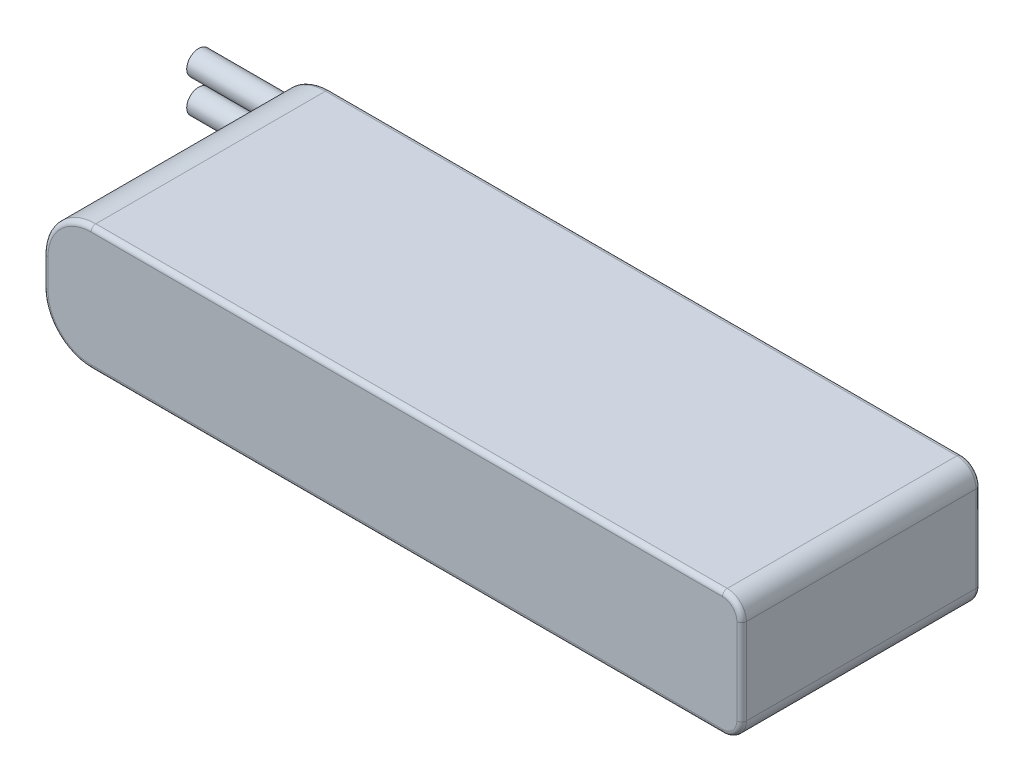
ISO-10303-21;
HEADER;
FILE_DESCRIPTION(('STEP AP214'),'2;1');
FILE_NAME('part.step','',(''),(''),'','','');
FILE_SCHEMA(('AUTOMOTIVE_DESIGN { 1 0 10303 214 1 1 1 1 }'));
ENDSEC;
DATA;
#1=APPLICATION_CONTEXT('core data for automotive mechanical design processes');
#2=APPLICATION_PROTOCOL_DEFINITION('international standard','automotive_design',2000,#1);
#3=PRODUCT_CONTEXT('',#1,'mechanical');
#4=PRODUCT('Part','Part','',(#3));
#5=PRODUCT_RELATED_PRODUCT_CATEGORY('part','',(#4));
#6=PRODUCT_DEFINITION_FORMATION('','',#4);
#7=PRODUCT_DEFINITION_CONTEXT('part definition',#1,'design');
#8=PRODUCT_DEFINITION('design','',#6,#7);
#9=PRODUCT_DEFINITION_SHAPE('','',#8);
#10=(LENGTH_UNIT() NAMED_UNIT(*) SI_UNIT(.MILLI.,.METRE.));
#11=(NAMED_UNIT(*) PLANE_ANGLE_UNIT() SI_UNIT($,.RADIAN.));
#12=(NAMED_UNIT(*) SI_UNIT($,.STERADIAN.) SOLID_ANGLE_UNIT());
#13=UNCERTAINTY_MEASURE_WITH_UNIT(LENGTH_MEASURE(1.E-05),#10,'distance_accuracy_value','');
#14=(GEOMETRIC_REPRESENTATION_CONTEXT(3) GLOBAL_UNCERTAINTY_ASSIGNED_CONTEXT((#13)) GLOBAL_UNIT_ASSIGNED_CONTEXT((#10,
#11,#12)) REPRESENTATION_CONTEXT('',''));
#15=CARTESIAN_POINT('',(0.,0.,0.));
#16=DIRECTION('',(0.,0.,1.));
#17=DIRECTION('',(1.,0.,0.));
#18=AXIS2_PLACEMENT_3D('',#15,#16,#17);
#19=CARTESIAN_POINT('',(-73.,26.,25.));
#20=DIRECTION('',(1.,0.,0.));
#21=DIRECTION('',(0.,0.,-1.));
#22=AXIS2_PLACEMENT_3D('',#19,#20,#21);
#23=PLANE('',#22);
#24=DIRECTION('',(0.,-1.,0.));
#25=VECTOR('',#24,1.);
#26=CARTESIAN_POINT('',(-73.,26.,-24.));
#27=LINE('',#26,#25);
#28=CARTESIAN_POINT('',(-73.,14.5,-24.));
#29=VERTEX_POINT('',#28);
#30=CARTESIAN_POINT('',(-73.,11.5,-24.));
#31=VERTEX_POINT('',#30);
#32=EDGE_CURVE('E375',#29,#31,#27,.T.);
#33=ORIENTED_EDGE('',*,*,#32,.T.);
#34=CARTESIAN_POINT('',(-73.,9.5,-25.5));
#35=DIRECTION('',(1.,0.,0.));
#36=DIRECTION('',(0.,0.,-1.));
#37=AXIS2_PLACEMENT_3D('',#34,#35,#36);
#38=CIRCLE('',#37,2.5);
#39=CARTESIAN_POINT('',(-73.,10.,-23.0505102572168));
#40=VERTEX_POINT('',#39);
#41=EDGE_CURVE('E205',#31,#40,#38,.T.);
#42=ORIENTED_EDGE('',*,*,#41,.T.);
#43=DIRECTION('',(0.,0.,1.));
#44=VECTOR('',#43,1.);
#45=CARTESIAN_POINT('',(-73.,10.,25.));
#46=LINE('',#45,#44);
#47=CARTESIAN_POINT('',(-73.,10.,24.));
#48=VERTEX_POINT('',#47);
#49=EDGE_CURVE('E331',#40,#48,#46,.T.);
#50=ORIENTED_EDGE('',*,*,#49,.T.);
#51=DIRECTION('',(0.,-1.,0.));
#52=VECTOR('',#51,1.);
#53=CARTESIAN_POINT('',(-73.,26.,24.));
#54=LINE('',#53,#52);
#55=CARTESIAN_POINT('',(-73.,16.,24.));
#56=VERTEX_POINT('',#55);
#57=EDGE_CURVE('E378',#48,#56,#54,.F.);
#58=ORIENTED_EDGE('',*,*,#57,.T.);
#59=DIRECTION('',(0.,0.,1.));
#60=VECTOR('',#59,1.);
#61=CARTESIAN_POINT('',(-73.,16.,-25.));
#62=LINE('',#61,#60);
#63=CARTESIAN_POINT('',(-73.,16.,-23.0505102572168));
#64=VERTEX_POINT('',#63);
#65=EDGE_CURVE('E327',#56,#64,#62,.F.);
#66=ORIENTED_EDGE('',*,*,#65,.T.);
#67=CARTESIAN_POINT('',(-73.,16.5,-25.5));
#68=DIRECTION('',(1.,0.,0.));
#69=DIRECTION('',(0.,0.,-1.));
#70=AXIS2_PLACEMENT_3D('',#67,#68,#69);
#71=CIRCLE('',#70,2.5);
#72=EDGE_CURVE('E306',#64,#29,#71,.T.);
#73=ORIENTED_EDGE('',*,*,#72,.T.);
#74=EDGE_LOOP('',(#33,#42,#50,#58,#66,#73));
#75=FACE_BOUND('',#74,.T.);
#76=ADVANCED_FACE('F45',(#75),#23,.F.);
#77=CARTESIAN_POINT('',(73.,26.,25.));
#78=DIRECTION('',(0.,0.,-1.));
#79=DIRECTION('',(-1.,0.,0.));
#80=AXIS2_PLACEMENT_3D('',#77,#78,#79);
#81=PLANE('',#80);
#82=DIRECTION('',(1.,0.,0.));
#83=VECTOR('',#82,1.);
#84=CARTESIAN_POINT('',(-63.,25.,25.));
#85=LINE('',#84,#83);
#86=CARTESIAN_POINT('',(69.,25.,25.));
#87=VERTEX_POINT('',#86);
#88=CARTESIAN_POINT('',(-63.,25.,25.));
#89=VERTEX_POINT('',#88);
#90=EDGE_CURVE('E342',#87,#89,#85,.F.);
#91=ORIENTED_EDGE('',*,*,#90,.T.);
#92=CARTESIAN_POINT('',(-63.,16.,25.));
#93=DIRECTION('',(0.,0.,-1.));
#94=DIRECTION('',(-1.,0.,0.));
#95=AXIS2_PLACEMENT_3D('',#92,#93,#94);
#96=CIRCLE('',#95,9.);
#97=CARTESIAN_POINT('',(-72.,16.,25.));
#98=VERTEX_POINT('',#97);
#99=EDGE_CURVE('E363',#89,#98,#96,.F.);
#100=ORIENTED_EDGE('',*,*,#99,.T.);
#101=DIRECTION('',(0.,-1.,0.));
#102=VECTOR('',#101,1.);
#103=CARTESIAN_POINT('',(-72.,26.,25.));
#104=LINE('',#103,#102);
#105=CARTESIAN_POINT('',(-72.,10.,25.));
#106=VERTEX_POINT('',#105);
#107=EDGE_CURVE('E360',#98,#106,#104,.T.);
#108=ORIENTED_EDGE('',*,*,#107,.T.);
#109=CARTESIAN_POINT('',(-63.,10.,25.));
#110=DIRECTION('',(0.,0.,-1.));
#111=DIRECTION('',(-1.,0.,0.));
#112=AXIS2_PLACEMENT_3D('',#109,#110,#111);
#113=CIRCLE('',#112,9.);
#114=CARTESIAN_POINT('',(-63.,1.,25.));
#115=VERTEX_POINT('',#114);
#116=EDGE_CURVE('E357',#106,#115,#113,.F.);
#117=ORIENTED_EDGE('',*,*,#116,.T.);
#118=DIRECTION('',(1.,0.,0.));
#119=VECTOR('',#118,1.);
#120=CARTESIAN_POINT('',(73.,1.,25.));
#121=LINE('',#120,#119);
#122=CARTESIAN_POINT('',(69.,1.,25.));
#123=VERTEX_POINT('',#122);
#124=EDGE_CURVE('E354',#115,#123,#121,.T.);
#125=ORIENTED_EDGE('',*,*,#124,.T.);
#126=CARTESIAN_POINT('',(69.,4.,25.));
#127=DIRECTION('',(0.,0.,-1.));
#128=DIRECTION('',(-1.,0.,0.));
#129=AXIS2_PLACEMENT_3D('',#126,#127,#128);
#130=CIRCLE('',#129,3.);
#131=CARTESIAN_POINT('',(72.,4.,25.));
#132=VERTEX_POINT('',#131);
#133=EDGE_CURVE('E351',#123,#132,#130,.F.);
#134=ORIENTED_EDGE('',*,*,#133,.T.);
#135=DIRECTION('',(0.,-1.,0.));
#136=VECTOR('',#135,1.);
#137=CARTESIAN_POINT('',(72.,26.,25.));
#138=LINE('',#137,#136);
#139=CARTESIAN_POINT('',(72.,22.,25.));
#140=VERTEX_POINT('',#139);
#141=EDGE_CURVE('E348',#132,#140,#138,.F.);
#142=ORIENTED_EDGE('',*,*,#141,.T.);
#143=CARTESIAN_POINT('',(69.,22.,25.));
#144=DIRECTION('',(0.,0.,-1.));
#145=DIRECTION('',(-1.,0.,0.));
#146=AXIS2_PLACEMENT_3D('',#143,#144,#145);
#147=CIRCLE('',#146,3.);
#148=EDGE_CURVE('E345',#140,#87,#147,.F.);
#149=ORIENTED_EDGE('',*,*,#148,.T.);
#150=EDGE_LOOP('',(#91,#100,#108,#117,#125,#134,#142,#149));
#151=FACE_BOUND('',#150,.T.);
#152=ADVANCED_FACE('F515',(#151),#81,.F.);
#153=CARTESIAN_POINT('',(73.,26.,25.));
#154=DIRECTION('',(-1.,0.,0.));
#155=DIRECTION('',(0.,0.,1.));
#156=AXIS2_PLACEMENT_3D('',#153,#154,#155);
#157=PLANE('',#156);
#158=DIRECTION('',(0.,0.,-1.));
#159=VECTOR('',#158,1.);
#160=CARTESIAN_POINT('',(73.,22.,25.));
#161=LINE('',#160,#159);
#162=CARTESIAN_POINT('',(73.,22.,-24.));
#163=VERTEX_POINT('',#162);
#164=CARTESIAN_POINT('',(73.,22.,24.));
#165=VERTEX_POINT('',#164);
#166=EDGE_CURVE('E310',#163,#165,#161,.F.);
#167=ORIENTED_EDGE('',*,*,#166,.T.);
#168=DIRECTION('',(0.,-1.,0.));
#169=VECTOR('',#168,1.);
#170=CARTESIAN_POINT('',(73.,26.,24.));
#171=LINE('',#170,#169);
#172=CARTESIAN_POINT('',(73.,4.,24.));
#173=VERTEX_POINT('',#172);
#174=EDGE_CURVE('E403',#165,#173,#171,.T.);
#175=ORIENTED_EDGE('',*,*,#174,.T.);
#176=DIRECTION('',(0.,0.,-1.));
#177=VECTOR('',#176,1.);
#178=CARTESIAN_POINT('',(73.,4.,25.));
#179=LINE('',#178,#177);
#180=CARTESIAN_POINT('',(73.,4.,-24.));
#181=VERTEX_POINT('',#180);
#182=EDGE_CURVE('E314',#173,#181,#179,.T.);
#183=ORIENTED_EDGE('',*,*,#182,.T.);
#184=DIRECTION('',(0.,-1.,0.));
#185=VECTOR('',#184,1.);
#186=CARTESIAN_POINT('',(73.,26.,-24.));
#187=LINE('',#186,#185);
#188=EDGE_CURVE('E400',#181,#163,#187,.F.);
#189=ORIENTED_EDGE('',*,*,#188,.T.);
#190=EDGE_LOOP('',(#167,#175,#183,#189));
#191=FACE_BOUND('',#190,.T.);
#192=ADVANCED_FACE('F521',(#191),#157,.F.);
#193=CARTESIAN_POINT('',(73.,26.,-25.));
#194=DIRECTION('',(0.,0.,1.));
#195=DIRECTION('',(1.,0.,0.));
#196=AXIS2_PLACEMENT_3D('',#193,#194,#195);
#197=PLANE('',#196);
#198=DIRECTION('',(0.,-1.,0.));
#199=VECTOR('',#198,1.);
#200=CARTESIAN_POINT('',(-63.,26.,-25.));
#201=LINE('',#200,#199);
#202=CARTESIAN_POINT('',(-63.,11.9494897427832,-25.));
#203=VERTEX_POINT('',#202);
#204=CARTESIAN_POINT('',(-63.,7.05051025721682,-25.));
#205=VERTEX_POINT('',#204);
#206=EDGE_CURVE('E11',#203,#205,#201,.T.);
#207=ORIENTED_EDGE('',*,*,#206,.F.);
#208=DIRECTION('',(-1.,0.,0.));
#209=VECTOR('',#208,1.);
#210=CARTESIAN_POINT('',(-63.,11.9494897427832,-25.));
#211=LINE('',#210,#209);
#212=CARTESIAN_POINT('',(-72.,11.9494897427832,-25.));
#213=VERTEX_POINT('',#212);
#214=EDGE_CURVE('E199',#203,#213,#211,.T.);
#215=ORIENTED_EDGE('',*,*,#214,.T.);
#216=DIRECTION('',(0.,-1.,0.));
#217=VECTOR('',#216,1.);
#218=CARTESIAN_POINT('',(-72.,26.,-25.));
#219=LINE('',#218,#217);
#220=CARTESIAN_POINT('',(-72.,14.0505102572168,-25.));
#221=VERTEX_POINT('',#220);
#222=EDGE_CURVE('E187',#213,#221,#219,.F.);
#223=ORIENTED_EDGE('',*,*,#222,.T.);
#224=DIRECTION('',(-1.,0.,0.));
#225=VECTOR('',#224,1.);
#226=CARTESIAN_POINT('',(-63.,14.0505102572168,-25.));
#227=LINE('',#226,#225);
#228=CARTESIAN_POINT('',(-63.,14.0505102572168,-25.));
#229=VERTEX_POINT('',#228);
#230=EDGE_CURVE('E305',#221,#229,#227,.F.);
#231=ORIENTED_EDGE('',*,*,#230,.T.);
#232=DIRECTION('',(0.,-1.,0.));
#233=VECTOR('',#232,1.);
#234=CARTESIAN_POINT('',(-63.,26.,-25.));
#235=LINE('',#234,#233);
#236=CARTESIAN_POINT('',(-63.,18.9494897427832,-25.));
#237=VERTEX_POINT('',#236);
#238=EDGE_CURVE('E212',#237,#229,#235,.T.);
#239=ORIENTED_EDGE('',*,*,#238,.F.);
#240=DIRECTION('',(-1.,0.,0.));
#241=VECTOR('',#240,1.);
#242=CARTESIAN_POINT('',(-63.,18.9494897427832,-25.));
#243=LINE('',#242,#241);
#244=CARTESIAN_POINT('',(-71.5029706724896,18.9494897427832,-25.));
#245=VERTEX_POINT('',#244);
#246=EDGE_CURVE('E275',#237,#245,#243,.T.);
#247=ORIENTED_EDGE('',*,*,#246,.T.);
#248=CARTESIAN_POINT('',(-63.,16.,-25.));
#249=DIRECTION('',(0.,0.,1.));
#250=DIRECTION('',(1.,0.,0.));
#251=AXIS2_PLACEMENT_3D('',#248,#249,#250);
#252=CIRCLE('',#251,9.);
#253=CARTESIAN_POINT('',(-63.,25.,-25.));
#254=VERTEX_POINT('',#253);
#255=EDGE_CURVE('E197',#245,#254,#252,.F.);
#256=ORIENTED_EDGE('',*,*,#255,.T.);
#257=DIRECTION('',(-1.,0.,0.));
#258=VECTOR('',#257,1.);
#259=CARTESIAN_POINT('',(69.,25.,-25.));
#260=LINE('',#259,#258);
#261=CARTESIAN_POINT('',(69.,25.,-25.));
#262=VERTEX_POINT('',#261);
#263=EDGE_CURVE('E413',#254,#262,#260,.F.);
#264=ORIENTED_EDGE('',*,*,#263,.T.);
#265=CARTESIAN_POINT('',(69.,22.,-25.));
#266=DIRECTION('',(0.,0.,1.));
#267=DIRECTION('',(1.,0.,0.));
#268=AXIS2_PLACEMENT_3D('',#265,#266,#267);
#269=CIRCLE('',#268,3.);
#270=CARTESIAN_POINT('',(72.,22.,-25.));
#271=VERTEX_POINT('',#270);
#272=EDGE_CURVE('E429',#262,#271,#269,.F.);
#273=ORIENTED_EDGE('',*,*,#272,.T.);
#274=DIRECTION('',(0.,-1.,0.));
#275=VECTOR('',#274,1.);
#276=CARTESIAN_POINT('',(72.,26.,-25.));
#277=LINE('',#276,#275);
#278=CARTESIAN_POINT('',(72.,4.,-25.));
#279=VERTEX_POINT('',#278);
#280=EDGE_CURVE('E426',#271,#279,#277,.T.);
#281=ORIENTED_EDGE('',*,*,#280,.T.);
#282=CARTESIAN_POINT('',(69.,4.,-25.));
#283=DIRECTION('',(0.,0.,1.));
#284=DIRECTION('',(1.,0.,0.));
#285=AXIS2_PLACEMENT_3D('',#282,#283,#284);
#286=CIRCLE('',#285,3.);
#287=CARTESIAN_POINT('',(69.,1.,-25.));
#288=VERTEX_POINT('',#287);
#289=EDGE_CURVE('E423',#279,#288,#286,.F.);
#290=ORIENTED_EDGE('',*,*,#289,.T.);
#291=DIRECTION('',(-1.,0.,0.));
#292=VECTOR('',#291,1.);
#293=CARTESIAN_POINT('',(73.,1.,-25.));
#294=LINE('',#293,#292);
#295=CARTESIAN_POINT('',(-63.,0.999999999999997,-25.));
#296=VERTEX_POINT('',#295);
#297=EDGE_CURVE('E420',#288,#296,#294,.T.);
#298=ORIENTED_EDGE('',*,*,#297,.T.);
#299=CARTESIAN_POINT('',(-63.,10.,-25.));
#300=DIRECTION('',(0.,0.,1.));
#301=DIRECTION('',(1.,0.,0.));
#302=AXIS2_PLACEMENT_3D('',#299,#300,#301);
#303=CIRCLE('',#302,9.);
#304=CARTESIAN_POINT('',(-71.5029706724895,7.05051025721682,-25.));
#305=VERTEX_POINT('',#304);
#306=EDGE_CURVE('E196',#296,#305,#303,.F.);
#307=ORIENTED_EDGE('',*,*,#306,.T.);
#308=DIRECTION('',(-1.,0.,0.));
#309=VECTOR('',#308,1.);
#310=CARTESIAN_POINT('',(-63.,7.05051025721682,-25.));
#311=LINE('',#310,#309);
#312=EDGE_CURVE('E62',#305,#205,#311,.F.);
#313=ORIENTED_EDGE('',*,*,#312,.T.);
#314=EDGE_LOOP('',(#207,#215,#223,#231,#239,#247,#256,#264,#273,#281,#290,#298,#307,#313));
#315=FACE_BOUND('',#314,.T.);
#316=ADVANCED_FACE('F200',(#315),#197,.F.);
#317=CARTESIAN_POINT('',(0.,26.,0.));
#318=DIRECTION('',(0.,1.,0.));
#319=DIRECTION('',(0.,0.,1.));
#320=AXIS2_PLACEMENT_3D('',#317,#318,#319);
#321=PLANE('',#320);
#322=DIRECTION('',(0.,0.,1.));
#323=VECTOR('',#322,1.);
#324=CARTESIAN_POINT('',(-63.,26.,25.));
#325=LINE('',#324,#323);
#326=CARTESIAN_POINT('',(-63.,26.,-24.));
#327=VERTEX_POINT('',#326);
#328=CARTESIAN_POINT('',(-63.,26.,24.));
#329=VERTEX_POINT('',#328);
#330=EDGE_CURVE('E338',#327,#329,#325,.T.);
#331=ORIENTED_EDGE('',*,*,#330,.T.);
#332=DIRECTION('',(1.,0.,0.));
#333=VECTOR('',#332,1.);
#334=CARTESIAN_POINT('',(69.,26.,24.));
#335=LINE('',#334,#333);
#336=CARTESIAN_POINT('',(69.,26.,24.));
#337=VERTEX_POINT('',#336);
#338=EDGE_CURVE('E436',#329,#337,#335,.T.);
#339=ORIENTED_EDGE('',*,*,#338,.T.);
#340=DIRECTION('',(0.,0.,-1.));
#341=VECTOR('',#340,1.);
#342=CARTESIAN_POINT('',(69.,26.,-25.));
#343=LINE('',#342,#341);
#344=CARTESIAN_POINT('',(69.,26.,-24.));
#345=VERTEX_POINT('',#344);
#346=EDGE_CURVE('E323',#337,#345,#343,.T.);
#347=ORIENTED_EDGE('',*,*,#346,.T.);
#348=DIRECTION('',(-1.,0.,0.));
#349=VECTOR('',#348,1.);
#350=CARTESIAN_POINT('',(-63.,26.,-24.));
#351=LINE('',#350,#349);
#352=EDGE_CURVE('E433',#345,#327,#351,.T.);
#353=ORIENTED_EDGE('',*,*,#352,.T.);
#354=EDGE_LOOP('',(#331,#339,#347,#353));
#355=FACE_BOUND('',#354,.T.);
#356=ADVANCED_FACE('F288',(#355),#321,.T.);
#357=CARTESIAN_POINT('',(0.,0.,0.));
#358=DIRECTION('',(0.,1.,0.));
#359=DIRECTION('',(0.,0.,1.));
#360=AXIS2_PLACEMENT_3D('',#357,#358,#359);
#361=PLANE('',#360);
#362=DIRECTION('',(0.,0.,-1.));
#363=VECTOR('',#362,1.);
#364=CARTESIAN_POINT('',(69.,0.,0.));
#365=LINE('',#364,#363);
#366=CARTESIAN_POINT('',(69.,0.,-24.));
#367=VERTEX_POINT('',#366);
#368=CARTESIAN_POINT('',(69.,0.,24.));
#369=VERTEX_POINT('',#368);
#370=EDGE_CURVE('E319',#367,#369,#365,.F.);
#371=ORIENTED_EDGE('',*,*,#370,.T.);
#372=DIRECTION('',(1.,0.,0.));
#373=VECTOR('',#372,1.);
#374=CARTESIAN_POINT('',(0.,0.,24.));
#375=LINE('',#374,#373);
#376=CARTESIAN_POINT('',(-63.,0.,24.));
#377=VERTEX_POINT('',#376);
#378=EDGE_CURVE('E391',#369,#377,#375,.F.);
#379=ORIENTED_EDGE('',*,*,#378,.T.);
#380=DIRECTION('',(0.,0.,1.));
#381=VECTOR('',#380,1.);
#382=CARTESIAN_POINT('',(-63.,0.,0.));
#383=LINE('',#382,#381);
#384=CARTESIAN_POINT('',(-63.,0.,-24.));
#385=VERTEX_POINT('',#384);
#386=EDGE_CURVE('E334',#377,#385,#383,.F.);
#387=ORIENTED_EDGE('',*,*,#386,.T.);
#388=DIRECTION('',(-1.,0.,0.));
#389=VECTOR('',#388,1.);
#390=CARTESIAN_POINT('',(0.,0.,-24.));
#391=LINE('',#390,#389);
#392=EDGE_CURVE('E388',#385,#367,#391,.F.);
#393=ORIENTED_EDGE('',*,*,#392,.T.);
#394=EDGE_LOOP('',(#371,#379,#387,#393));
#395=FACE_BOUND('',#394,.T.);
#396=ADVANCED_FACE('F527',(#395),#361,.F.);
#397=CARTESIAN_POINT('',(69.,4.,25.));
#398=DIRECTION('',(0.,0.,-1.));
#399=DIRECTION('',(-1.,0.,0.));
#400=AXIS2_PLACEMENT_3D('',#397,#398,#399);
#401=CYLINDRICAL_SURFACE('',#400,4.);
#402=ORIENTED_EDGE('',*,*,#182,.F.);
#403=CARTESIAN_POINT('',(69.,4.,24.));
#404=DIRECTION('',(0.,0.,-1.));
#405=DIRECTION('',(-1.,0.,0.));
#406=AXIS2_PLACEMENT_3D('',#403,#404,#405);
#407=CIRCLE('',#406,4.);
#408=EDGE_CURVE('E397',#173,#369,#407,.T.);
#409=ORIENTED_EDGE('',*,*,#408,.T.);
#410=ORIENTED_EDGE('',*,*,#370,.F.);
#411=CARTESIAN_POINT('',(69.,4.,-24.));
#412=DIRECTION('',(0.,0.,1.));
#413=DIRECTION('',(1.,0.,0.));
#414=AXIS2_PLACEMENT_3D('',#411,#412,#413);
#415=CIRCLE('',#414,4.);
#416=EDGE_CURVE('E394',#367,#181,#415,.T.);
#417=ORIENTED_EDGE('',*,*,#416,.T.);
#418=EDGE_LOOP('',(#402,#409,#410,#417));
#419=FACE_BOUND('',#418,.T.);
#420=ADVANCED_FACE('F525',(#419),#401,.T.);
#421=CARTESIAN_POINT('',(69.,22.,0.));
#422=DIRECTION('',(0.,0.,1.));
#423=DIRECTION('',(1.,0.,0.));
#424=AXIS2_PLACEMENT_3D('',#421,#422,#423);
#425=CYLINDRICAL_SURFACE('',#424,4.);
#426=ORIENTED_EDGE('',*,*,#346,.F.);
#427=CARTESIAN_POINT('',(69.,22.,24.));
#428=DIRECTION('',(0.,0.,-1.));
#429=DIRECTION('',(-1.,0.,0.));
#430=AXIS2_PLACEMENT_3D('',#427,#428,#429);
#431=CIRCLE('',#430,4.);
#432=EDGE_CURVE('E410',#337,#165,#431,.T.);
#433=ORIENTED_EDGE('',*,*,#432,.T.);
#434=ORIENTED_EDGE('',*,*,#166,.F.);
#435=CARTESIAN_POINT('',(69.,22.,-24.));
#436=DIRECTION('',(0.,0.,1.));
#437=DIRECTION('',(1.,0.,0.));
#438=AXIS2_PLACEMENT_3D('',#435,#436,#437);
#439=CIRCLE('',#438,4.);
#440=EDGE_CURVE('E406',#163,#345,#439,.T.);
#441=ORIENTED_EDGE('',*,*,#440,.T.);
#442=EDGE_LOOP('',(#426,#433,#434,#441));
#443=FACE_BOUND('',#442,.T.);
#444=ADVANCED_FACE('F255',(#443),#425,.T.);
#445=CARTESIAN_POINT('',(-63.,10.,25.));
#446=DIRECTION('',(0.,0.,1.));
#447=DIRECTION('',(1.,0.,0.));
#448=AXIS2_PLACEMENT_3D('',#445,#446,#447);
#449=CYLINDRICAL_SURFACE('',#448,10.);
#450=CARTESIAN_POINT('',(-72.9874921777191,9.5,-23.));
#451=CARTESIAN_POINT('',(-72.9943595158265,9.6372133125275,-23.0000033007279));
#452=CARTESIAN_POINT('',(-72.9983773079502,9.77460610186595,-23.0113332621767));
#453=CARTESIAN_POINT('',(-73.000815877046,10.0457498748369,-23.0564242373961));
#454=CARTESIAN_POINT('',(-72.9992342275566,10.1794992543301,-23.0901949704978));
#455=CARTESIAN_POINT('',(-72.9911878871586,10.439389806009,-23.1791393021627));
#456=CARTESIAN_POINT('',(-72.984727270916,10.5655372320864,-23.2342950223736));
#457=CARTESIAN_POINT('',(-72.9681277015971,10.8068979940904,-23.3643925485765));
#458=CARTESIAN_POINT('',(-72.9579885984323,10.9221108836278,-23.4393351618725));
#459=CARTESIAN_POINT('',(-72.9354159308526,11.1400381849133,-23.6080395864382));
#460=CARTESIAN_POINT('',(-72.922953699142,11.2425664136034,-23.7020379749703));
#461=CARTESIAN_POINT('',(-72.8975909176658,11.4306359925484,-23.905679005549));
#462=CARTESIAN_POINT('',(-72.8846903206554,11.5161755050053,-24.0153233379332));
#463=CARTESIAN_POINT('',(-72.8599963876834,11.6693149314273,-24.2494114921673));
#464=CARTESIAN_POINT('',(-72.84822640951,11.7365743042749,-24.374080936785));
#465=CARTESIAN_POINT('',(-72.8277095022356,11.8491677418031,-24.6331898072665));
#466=CARTESIAN_POINT('',(-72.8189623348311,11.8945035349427,-24.7676284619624));
#467=CARTESIAN_POINT('',(-72.805793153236,11.961527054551,-25.041166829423));
#468=CARTESIAN_POINT('',(-72.8013318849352,11.9834296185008,-25.1802119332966));
#469=CARTESIAN_POINT('',(-72.797226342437,12.0036138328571,-25.460069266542));
#470=CARTESIAN_POINT('',(-72.797581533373,12.0018981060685,-25.6008812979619));
#471=CARTESIAN_POINT('',(-72.8030105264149,11.9751348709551,-25.8778127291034));
#472=CARTESIAN_POINT('',(-72.808006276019,11.950473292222,-26.0139712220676));
#473=CARTESIAN_POINT('',(-72.8219213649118,11.879140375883,-26.2801817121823));
#474=CARTESIAN_POINT('',(-72.8308409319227,11.8324677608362,-26.4102333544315));
#475=CARTESIAN_POINT('',(-72.8514715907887,11.7181059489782,-26.6615484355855));
#476=CARTESIAN_POINT('',(-72.8632009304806,11.6502784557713,-26.782747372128));
#477=CARTESIAN_POINT('',(-72.887836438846,11.4955954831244,-27.012199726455));
#478=CARTESIAN_POINT('',(-72.9007427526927,11.4087376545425,-27.120451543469));
#479=CARTESIAN_POINT('',(-72.9262007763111,11.2165837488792,-27.3229553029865));
#480=CARTESIAN_POINT('',(-72.938742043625,11.1109862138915,-27.4169228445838));
#481=CARTESIAN_POINT('',(-72.961378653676,10.8853094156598,-27.5858527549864));
#482=CARTESIAN_POINT('',(-72.9714740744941,10.7652306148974,-27.6608157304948));
#483=CARTESIAN_POINT('',(-72.9875440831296,10.5144547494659,-27.7892443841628));
#484=CARTESIAN_POINT('',(-72.9935359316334,10.3838047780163,-27.8427997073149));
#485=CARTESIAN_POINT('',(-73.00023692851,10.1152411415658,-27.927196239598));
#486=CARTESIAN_POINT('',(-73.0009470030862,9.97732875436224,-27.9580414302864));
#487=CARTESIAN_POINT('',(-72.9964756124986,9.70158117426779,-27.9956533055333));
#488=CARTESIAN_POINT('',(-72.9914287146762,9.56381656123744,-28.0029553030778));
#489=CARTESIAN_POINT('',(-72.9756601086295,9.28929027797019,-27.9948864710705));
#490=CARTESIAN_POINT('',(-72.9649385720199,9.15252857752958,-27.9795163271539));
#491=CARTESIAN_POINT('',(-72.9384927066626,8.88445752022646,-27.9268677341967));
#492=CARTESIAN_POINT('',(-72.9227910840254,8.75312641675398,-27.8896880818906));
#493=CARTESIAN_POINT('',(-72.8874966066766,8.49869207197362,-27.7947394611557));
#494=CARTESIAN_POINT('',(-72.8679031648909,8.37559007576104,-27.7369673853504));
#495=CARTESIAN_POINT('',(-72.8257857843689,8.13748772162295,-27.6006853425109));
#496=CARTESIAN_POINT('',(-72.8031972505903,8.02279392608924,-27.5216598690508));
#497=CARTESIAN_POINT('',(-72.7574470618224,7.80813014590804,-27.3457627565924));
#498=CARTESIAN_POINT('',(-72.734285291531,7.70816315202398,-27.2488875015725));
#499=CARTESIAN_POINT('',(-72.6889033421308,7.52321548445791,-27.0370682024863));
#500=CARTESIAN_POINT('',(-72.6667213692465,7.43867375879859,-26.9217317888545));
#501=CARTESIAN_POINT('',(-72.6261688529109,7.29023651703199,-26.6778436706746));
#502=CARTESIAN_POINT('',(-72.6077978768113,7.22633865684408,-26.5492934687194));
#503=CARTESIAN_POINT('',(-72.577107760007,7.12216633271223,-26.2847184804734));
#504=CARTESIAN_POINT('',(-72.5646943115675,7.08152163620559,-26.1488508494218));
#505=CARTESIAN_POINT('',(-72.5468786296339,7.02375362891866,-25.8717714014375));
#506=CARTESIAN_POINT('',(-72.5414741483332,7.00662277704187,-25.730561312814));
#507=CARTESIAN_POINT('',(-72.5383695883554,6.9967478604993,-25.4530930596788));
#508=CARTESIAN_POINT('',(-72.5403592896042,7.00302189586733,-25.3168723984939));
#509=CARTESIAN_POINT('',(-72.551133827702,7.03754099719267,-25.0475305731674));
#510=CARTESIAN_POINT('',(-72.5599184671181,7.06578542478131,-24.9144093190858));
#511=CARTESIAN_POINT('',(-72.5832543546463,7.14293365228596,-24.6560354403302));
#512=CARTESIAN_POINT('',(-72.5977586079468,7.19166929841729,-24.5307280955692));
#513=CARTESIAN_POINT('',(-72.6311043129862,7.30825517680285,-24.2899783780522));
#514=CARTESIAN_POINT('',(-72.6499465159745,7.37610872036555,-24.1745377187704));
#515=CARTESIAN_POINT('',(-72.6909720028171,7.53185064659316,-23.9522712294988));
#516=CARTESIAN_POINT('',(-72.713251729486,7.62037680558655,-23.8459101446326));
#517=CARTESIAN_POINT('',(-72.7585706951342,7.81364778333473,-23.6492618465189));
#518=CARTESIAN_POINT('',(-72.7816101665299,7.91839760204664,-23.5589796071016));
#519=CARTESIAN_POINT('',(-72.8271473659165,8.14502524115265,-23.3942274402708));
#520=CARTESIAN_POINT('',(-72.8496053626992,8.26733762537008,-23.3203430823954));
#521=CARTESIAN_POINT('',(-72.8911938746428,8.523169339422,-23.1943318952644));
#522=CARTESIAN_POINT('',(-72.9103264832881,8.65668153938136,-23.1421913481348));
#523=CARTESIAN_POINT('',(-72.9408681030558,8.90803539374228,-23.0681805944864));
#524=CARTESIAN_POINT('',(-72.9530350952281,9.02473202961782,-23.0426924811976));
#525=CARTESIAN_POINT('',(-72.9733536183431,9.26090720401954,-23.0086017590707));
#526=CARTESIAN_POINT('',(-72.9815056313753,9.3803854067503,-22.9999971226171));
#527=CARTESIAN_POINT('',(-72.9874921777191,9.5,-23.));
#528=B_SPLINE_CURVE_WITH_KNOTS('',3,(#450,#451,#452,#453,#454,#455,#456,#457,#458,#459,#460,
#461,#462,#463,#464,#465,#466,#467,#468,#469,#470,#471,#472,#473,#474,#475,#476,#477,#478,#479,
#480,#481,#482,#483,#484,#485,#486,#487,#488,#489,#490,#491,#492,#493,#494,#495,#496,#497,#498,
#499,#500,#501,#502,#503,#504,#505,#506,#507,#508,#509,#510,#511,#512,#513,#514,#515,#516,#517,
#518,#519,#520,#521,#522,#523,#524,#525,#526,#527),.UNSPECIFIED.,.T.,.F.,(4,2,2,2,2,2,2,2,2,2,2,
2,2,2,2,2,2,2,2,2,2,2,2,2,2,2,2,2,2,2,2,2,2,2,2,2,2,2,4),(0.,0.411723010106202,
0.823624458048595,1.23518228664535,1.64675690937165,2.06379418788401,2.48087655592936,
2.90526586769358,3.3296217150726,3.75005279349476,4.17043718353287,4.58387645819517,
4.99733973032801,5.41356469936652,5.82984107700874,6.25354826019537,6.67724191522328,
7.09914227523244,7.52096864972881,7.93313351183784,8.34528590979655,8.75558552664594,
9.16594708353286,9.58733483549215,10.0088080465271,10.440856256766,10.872855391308,
11.2977698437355,11.7225479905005,12.1297098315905,12.5368598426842,12.9407319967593,
13.3446741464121,13.7632773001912,14.1820097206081,14.6138912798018,15.0454999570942,
15.4044592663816,15.76337546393),.UNSPECIFIED.);
#529=CARTESIAN_POINT('',(-72.6824583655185,7.5,-24.));
#530=VERTEX_POINT('',#529);
#531=EDGE_CURVE('E236',#530,#40,#528,.T.);
#532=ORIENTED_EDGE('',*,*,#531,.F.);
#533=CARTESIAN_POINT('',(-63.,10.,-24.));
#534=DIRECTION('',(0.,0.,1.));
#535=DIRECTION('',(1.,0.,0.));
#536=AXIS2_PLACEMENT_3D('',#533,#534,#535);
#537=CIRCLE('',#536,10.);
#538=EDGE_CURVE('E381',#530,#385,#537,.T.);
#539=ORIENTED_EDGE('',*,*,#538,.T.);
#540=ORIENTED_EDGE('',*,*,#386,.F.);
#541=CARTESIAN_POINT('',(-63.,10.,24.));
#542=DIRECTION('',(0.,0.,-1.));
#543=DIRECTION('',(-1.,0.,0.));
#544=AXIS2_PLACEMENT_3D('',#541,#542,#543);
#545=CIRCLE('',#544,10.);
#546=EDGE_CURVE('E384',#377,#48,#545,.T.);
#547=ORIENTED_EDGE('',*,*,#546,.T.);
#548=ORIENTED_EDGE('',*,*,#49,.F.);
#549=EDGE_LOOP('',(#532,#539,#540,#547,#548));
#550=FACE_BOUND('',#549,.T.);
#551=ADVANCED_FACE('F249',(#550),#449,.T.);
#552=CARTESIAN_POINT('',(-63.,16.,0.));
#553=DIRECTION('',(0.,0.,-1.));
#554=DIRECTION('',(-1.,0.,0.));
#555=AXIS2_PLACEMENT_3D('',#552,#553,#554);
#556=CYLINDRICAL_SURFACE('',#555,10.);
#557=CARTESIAN_POINT('',(-73.,16.,-23.0505102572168));
#558=CARTESIAN_POINT('',(-72.9999976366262,16.1347077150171,-23.0230168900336));
#559=CARTESIAN_POINT('',(-72.9972513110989,16.271729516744,-23.006656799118));
#560=CARTESIAN_POINT('',(-72.9860081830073,16.5464025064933,-22.9966518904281));
#561=CARTESIAN_POINT('',(-72.9775088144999,16.6840539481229,-23.0030172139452));
#562=CARTESIAN_POINT('',(-72.9551427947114,16.9558850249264,-23.0381040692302));
#563=CARTESIAN_POINT('',(-72.9412812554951,17.090067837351,-23.0668043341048));
#564=CARTESIAN_POINT('',(-72.9091333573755,17.3514562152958,-23.1455022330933));
#565=CARTESIAN_POINT('',(-72.8908468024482,17.4786614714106,-23.1955008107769));
#566=CARTESIAN_POINT('',(-72.8509192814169,17.7248797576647,-23.3162466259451));
#567=CARTESIAN_POINT('',(-72.8292281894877,17.8437240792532,-23.3873209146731));
#568=CARTESIAN_POINT('',(-72.7845139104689,18.0679406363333,-23.5479271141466));
#569=CARTESIAN_POINT('',(-72.7614904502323,18.1733100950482,-23.6374628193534));
#570=CARTESIAN_POINT('',(-72.7154408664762,18.3708241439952,-23.8356222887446));
#571=CARTESIAN_POINT('',(-72.6924345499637,18.4624890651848,-23.9447296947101));
#572=CARTESIAN_POINT('',(-72.6493651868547,18.626202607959,-24.1773195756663));
#573=CARTESIAN_POINT('',(-72.6293020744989,18.6982516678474,-24.3008017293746));
#574=CARTESIAN_POINT('',(-72.594342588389,18.8200348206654,-24.5579163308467));
#575=CARTESIAN_POINT('',(-72.5794100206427,18.8699259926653,-24.6914692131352));
#576=CARTESIAN_POINT('',(-72.5561794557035,18.946362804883,-24.9656375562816));
#577=CARTESIAN_POINT('',(-72.5478792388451,18.9729162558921,-25.1062506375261));
#578=CARTESIAN_POINT('',(-72.5390664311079,19.0010694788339,-25.3843381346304));
#579=CARTESIAN_POINT('',(-72.5382478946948,19.0036496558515,-25.5217041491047));
#580=CARTESIAN_POINT('',(-72.543687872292,18.9863192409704,-25.7948561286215));
#581=CARTESIAN_POINT('',(-72.5499457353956,18.9664107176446,-25.9306422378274));
#582=CARTESIAN_POINT('',(-72.5686810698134,18.9053956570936,-26.1943059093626));
#583=CARTESIAN_POINT('',(-72.5810449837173,18.8646756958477,-26.3222816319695));
#584=CARTESIAN_POINT('',(-72.6106904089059,18.7635827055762,-26.5696021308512));
#585=CARTESIAN_POINT('',(-72.6279726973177,18.7032065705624,-26.6889455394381));
#586=CARTESIAN_POINT('',(-72.6664100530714,18.5624176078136,-26.919591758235));
#587=CARTESIAN_POINT('',(-72.6876670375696,18.4814505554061,-27.0305389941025));
#588=CARTESIAN_POINT('',(-72.731711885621,18.3026608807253,-27.237564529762));
#589=CARTESIAN_POINT('',(-72.7545000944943,18.2048344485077,-27.3336394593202));
#590=CARTESIAN_POINT('',(-72.8004481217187,17.9908793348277,-27.5118043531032));
#591=CARTESIAN_POINT('',(-72.823590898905,17.8742108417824,-27.59325189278));
#592=CARTESIAN_POINT('',(-72.8673149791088,17.6283918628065,-27.7353714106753));
#593=CARTESIAN_POINT('',(-72.8878963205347,17.4992415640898,-27.7960437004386));
#594=CARTESIAN_POINT('',(-72.924677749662,17.2324079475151,-27.8945202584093));
#595=CARTESIAN_POINT('',(-72.9408928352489,17.0947558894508,-27.9324033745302));
#596=CARTESIAN_POINT('',(-72.9677675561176,16.8144956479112,-27.9842277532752));
#597=CARTESIAN_POINT('',(-72.9784284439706,16.6718885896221,-27.9981744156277));
#598=CARTESIAN_POINT('',(-72.993328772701,16.3906243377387,-28.0014368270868));
#599=CARTESIAN_POINT('',(-72.9977619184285,16.251986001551,-27.9915229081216));
#600=CARTESIAN_POINT('',(-73.0009132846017,15.9782098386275,-27.948861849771));
#601=CARTESIAN_POINT('',(-72.9996319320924,15.8430717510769,-27.9161164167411));
#602=CARTESIAN_POINT('',(-72.9921035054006,15.5820223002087,-27.8293735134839));
#603=CARTESIAN_POINT('',(-72.9859245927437,15.4560100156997,-27.7756728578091));
#604=CARTESIAN_POINT('',(-72.9698449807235,15.2146063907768,-27.6485753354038));
#605=CARTESIAN_POINT('',(-72.9599438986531,15.0992161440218,-27.5751764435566));
#606=CARTESIAN_POINT('',(-72.9377185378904,14.880132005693,-27.4092517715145));
#607=CARTESIAN_POINT('',(-72.9253545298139,14.7766808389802,-27.3164109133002));
#608=CARTESIAN_POINT('',(-72.9000737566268,14.5865800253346,-27.1149340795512));
#609=CARTESIAN_POINT('',(-72.887156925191,14.4999324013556,-27.0062962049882));
#610=CARTESIAN_POINT('',(-72.862310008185,14.344349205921,-26.7739934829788));
#611=CARTESIAN_POINT('',(-72.8504019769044,14.2757620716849,-26.6500925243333));
#612=CARTESIAN_POINT('',(-72.8295121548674,14.160394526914,-26.3922917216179));
#613=CARTESIAN_POINT('',(-72.8205301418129,14.113612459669,-26.258392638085));
#614=CARTESIAN_POINT('',(-72.8068231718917,14.0436018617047,-25.9855640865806));
#615=CARTESIAN_POINT('',(-72.8020628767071,14.020177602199,-25.8466866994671));
#616=CARTESIAN_POINT('',(-72.7973448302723,13.9969568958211,-25.5668968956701));
#617=CARTESIAN_POINT('',(-72.7973865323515,13.9971577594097,-25.4259847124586));
#618=CARTESIAN_POINT('',(-72.8022226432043,14.0209682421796,-25.1486484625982));
#619=CARTESIAN_POINT('',(-72.8069367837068,14.0441825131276,-25.0121887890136));
#620=CARTESIAN_POINT('',(-72.820351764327,14.1127010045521,-24.7451436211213));
#621=CARTESIAN_POINT('',(-72.8290527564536,14.1580060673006,-24.6145583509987));
#622=CARTESIAN_POINT('',(-72.8493271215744,14.2696886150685,-24.3620719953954));
#623=CARTESIAN_POINT('',(-72.860916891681,14.336187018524,-24.2402257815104));
#624=CARTESIAN_POINT('',(-72.8853819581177,14.488331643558,-24.0092550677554));
#625=CARTESIAN_POINT('',(-72.8982575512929,14.5739822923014,-23.9001335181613));
#626=CARTESIAN_POINT('',(-72.9237763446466,14.7638804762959,-23.6956400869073));
#627=CARTESIAN_POINT('',(-72.9364109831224,14.8684395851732,-23.6005562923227));
#628=CARTESIAN_POINT('',(-72.9593420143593,15.0921946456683,-23.4292729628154));
#629=CARTESIAN_POINT('',(-72.9696397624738,15.2113820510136,-23.3530624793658));
#630=CARTESIAN_POINT('',(-72.9848782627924,15.4404220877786,-23.2325844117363));
#631=CARTESIAN_POINT('',(-72.9904228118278,15.5485662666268,-23.1851202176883));
#632=CARTESIAN_POINT('',(-72.9979845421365,15.7705729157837,-23.1058770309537));
#633=CARTESIAN_POINT('',(-73.0000020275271,15.8844348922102,-23.0740966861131));
#634=CARTESIAN_POINT('',(-73.,16.,-23.0505102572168));
#635=B_SPLINE_CURVE_WITH_KNOTS('',3,(#557,#558,#559,#560,#561,#562,#563,#564,#565,#566,#567,
#568,#569,#570,#571,#572,#573,#574,#575,#576,#577,#578,#579,#580,#581,#582,#583,#584,#585,#586,
#587,#588,#589,#590,#591,#592,#593,#594,#595,#596,#597,#598,#599,#600,#601,#602,#603,#604,#605,
#606,#607,#608,#609,#610,#611,#612,#613,#614,#615,#616,#617,#618,#619,#620,#621,#622,#623,#624,
#625,#626,#627,#628,#629,#630,#631,#632,#633,#634),.UNSPECIFIED.,.T.,.F.,(4,2,2,2,2,2,2,2,2,2,2,
2,2,2,2,2,2,2,2,2,2,2,2,2,2,2,2,2,2,2,2,2,2,2,2,2,2,2,4),(0.,0.412027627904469,
0.824239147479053,1.23605864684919,1.64789639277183,2.06649303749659,2.48517580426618,
2.91616311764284,3.34714080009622,3.77501247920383,4.2027409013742,4.61289601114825,
5.02301339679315,5.42577559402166,5.82860146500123,6.24369555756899,6.65888357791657,
7.08930453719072,7.51971904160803,7.94863566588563,8.37745551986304,8.79261772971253,
9.20774891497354,9.61720188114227,10.0266969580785,10.4434283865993,10.860209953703,
11.2845245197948,11.7088068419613,12.1295032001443,12.550151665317,12.9636968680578,
13.3772578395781,13.7932219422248,14.2092822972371,14.6329547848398,15.0563809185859,
15.4098879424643,15.7633644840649),.UNSPECIFIED.);
#636=CARTESIAN_POINT('',(-72.6824583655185,18.5,-24.));
#637=VERTEX_POINT('',#636);
#638=EDGE_CURVE('E266',#64,#637,#635,.T.);
#639=ORIENTED_EDGE('',*,*,#638,.F.);
#640=ORIENTED_EDGE('',*,*,#65,.F.);
#641=CARTESIAN_POINT('',(-63.,16.,24.));
#642=DIRECTION('',(0.,0.,-1.));
#643=DIRECTION('',(-1.,0.,0.));
#644=AXIS2_PLACEMENT_3D('',#641,#642,#643);
#645=CIRCLE('',#644,10.);
#646=EDGE_CURVE('E371',#56,#329,#645,.T.);
#647=ORIENTED_EDGE('',*,*,#646,.T.);
#648=ORIENTED_EDGE('',*,*,#330,.F.);
#649=CARTESIAN_POINT('',(-63.,16.,-24.));
#650=DIRECTION('',(0.,0.,1.));
#651=DIRECTION('',(1.,0.,0.));
#652=AXIS2_PLACEMENT_3D('',#649,#650,#651);
#653=CIRCLE('',#652,10.);
#654=EDGE_CURVE('E367',#327,#637,#653,.T.);
#655=ORIENTED_EDGE('',*,*,#654,.T.);
#656=EDGE_LOOP('',(#639,#640,#647,#648,#655));
#657=FACE_BOUND('',#656,.T.);
#658=ADVANCED_FACE('F254',(#657),#556,.T.);
#659=CARTESIAN_POINT('',(69.,4.,24.));
#660=DIRECTION('',(0.,0.,-1.));
#661=DIRECTION('',(-1.,0.,0.));
#662=AXIS2_PLACEMENT_3D('',#659,#660,#661);
#663=TOROIDAL_SURFACE('',#662,3.,1.);
#664=CARTESIAN_POINT('',(69.,1.,24.));
#665=DIRECTION('',(-1.,0.,0.));
#666=DIRECTION('',(0.,0.,1.));
#667=AXIS2_PLACEMENT_3D('',#664,#665,#666);
#668=CIRCLE('',#667,1.);
#669=EDGE_CURVE('E462',#369,#123,#668,.T.);
#670=ORIENTED_EDGE('',*,*,#669,.F.);
#671=ORIENTED_EDGE('',*,*,#408,.F.);
#672=CARTESIAN_POINT('',(72.,4.,24.));
#673=DIRECTION('',(0.,1.,0.));
#674=DIRECTION('',(0.,0.,1.));
#675=AXIS2_PLACEMENT_3D('',#672,#673,#674);
#676=CIRCLE('',#675,1.);
#677=EDGE_CURVE('E315',#132,#173,#676,.T.);
#678=ORIENTED_EDGE('',*,*,#677,.F.);
#679=ORIENTED_EDGE('',*,*,#133,.F.);
#680=EDGE_LOOP('',(#670,#671,#678,#679));
#681=FACE_BOUND('',#680,.T.);
#682=ADVANCED_FACE('F261',(#681),#663,.T.);
#683=CARTESIAN_POINT('',(72.,26.,24.));
#684=DIRECTION('',(0.,-1.,0.));
#685=DIRECTION('',(0.,0.,-1.));
#686=AXIS2_PLACEMENT_3D('',#683,#684,#685);
#687=CYLINDRICAL_SURFACE('',#686,1.);
#688=ORIENTED_EDGE('',*,*,#677,.T.);
#689=ORIENTED_EDGE('',*,*,#174,.F.);
#690=CARTESIAN_POINT('',(72.,22.,24.));
#691=DIRECTION('',(0.,1.,0.));
#692=DIRECTION('',(0.,0.,1.));
#693=AXIS2_PLACEMENT_3D('',#690,#691,#692);
#694=CIRCLE('',#693,1.);
#695=EDGE_CURVE('E458',#140,#165,#694,.T.);
#696=ORIENTED_EDGE('',*,*,#695,.F.);
#697=ORIENTED_EDGE('',*,*,#141,.F.);
#698=EDGE_LOOP('',(#688,#689,#696,#697));
#699=FACE_BOUND('',#698,.T.);
#700=ADVANCED_FACE('F549',(#699),#687,.T.);
#701=CARTESIAN_POINT('',(73.,1.,24.));
#702=DIRECTION('',(1.,0.,0.));
#703=DIRECTION('',(0.,0.,-1.));
#704=AXIS2_PLACEMENT_3D('',#701,#702,#703);
#705=CYLINDRICAL_SURFACE('',#704,1.);
#706=ORIENTED_EDGE('',*,*,#669,.T.);
#707=ORIENTED_EDGE('',*,*,#124,.F.);
#708=CARTESIAN_POINT('',(-63.,1.,24.));
#709=DIRECTION('',(-1.,0.,0.));
#710=DIRECTION('',(0.,0.,1.));
#711=AXIS2_PLACEMENT_3D('',#708,#709,#710);
#712=CIRCLE('',#711,1.);
#713=EDGE_CURVE('E454',#377,#115,#712,.T.);
#714=ORIENTED_EDGE('',*,*,#713,.F.);
#715=ORIENTED_EDGE('',*,*,#378,.F.);
#716=EDGE_LOOP('',(#706,#707,#714,#715));
#717=FACE_BOUND('',#716,.T.);
#718=ADVANCED_FACE('F555',(#717),#705,.T.);
#719=CARTESIAN_POINT('',(69.,22.,24.));
#720=DIRECTION('',(0.,0.,-1.));
#721=DIRECTION('',(-1.,0.,0.));
#722=AXIS2_PLACEMENT_3D('',#719,#720,#721);
#723=TOROIDAL_SURFACE('',#722,3.,1.);
#724=ORIENTED_EDGE('',*,*,#695,.T.);
#725=ORIENTED_EDGE('',*,*,#432,.F.);
#726=CARTESIAN_POINT('',(69.,25.,24.));
#727=DIRECTION('',(-1.,0.,0.));
#728=DIRECTION('',(0.,0.,1.));
#729=AXIS2_PLACEMENT_3D('',#726,#727,#728);
#730=CIRCLE('',#729,1.);
#731=EDGE_CURVE('E450',#87,#337,#730,.T.);
#732=ORIENTED_EDGE('',*,*,#731,.F.);
#733=ORIENTED_EDGE('',*,*,#148,.F.);
#734=EDGE_LOOP('',(#724,#725,#732,#733));
#735=FACE_BOUND('',#734,.T.);
#736=ADVANCED_FACE('F635',(#735),#723,.T.);
#737=CARTESIAN_POINT('',(-63.,10.,24.));
#738=DIRECTION('',(0.,0.,-1.));
#739=DIRECTION('',(-1.,0.,0.));
#740=AXIS2_PLACEMENT_3D('',#737,#738,#739);
#741=TOROIDAL_SURFACE('',#740,9.,1.);
#742=ORIENTED_EDGE('',*,*,#713,.T.);
#743=ORIENTED_EDGE('',*,*,#116,.F.);
#744=CARTESIAN_POINT('',(-72.,10.,24.));
#745=DIRECTION('',(0.,1.,0.));
#746=DIRECTION('',(0.,0.,1.));
#747=AXIS2_PLACEMENT_3D('',#744,#745,#746);
#748=CIRCLE('',#747,1.);
#749=EDGE_CURVE('E446',#48,#106,#748,.T.);
#750=ORIENTED_EDGE('',*,*,#749,.F.);
#751=ORIENTED_EDGE('',*,*,#546,.F.);
#752=EDGE_LOOP('',(#742,#743,#750,#751));
#753=FACE_BOUND('',#752,.T.);
#754=ADVANCED_FACE('F701',(#753),#741,.T.);
#755=CARTESIAN_POINT('',(0.,25.,24.));
#756=DIRECTION('',(-1.,0.,0.));
#757=DIRECTION('',(0.,0.,1.));
#758=AXIS2_PLACEMENT_3D('',#755,#756,#757);
#759=CYLINDRICAL_SURFACE('',#758,1.);
#760=ORIENTED_EDGE('',*,*,#731,.T.);
#761=ORIENTED_EDGE('',*,*,#338,.F.);
#762=CARTESIAN_POINT('',(-63.,25.,24.));
#763=DIRECTION('',(-1.,0.,0.));
#764=DIRECTION('',(0.,0.,1.));
#765=AXIS2_PLACEMENT_3D('',#762,#763,#764);
#766=CIRCLE('',#765,1.);
#767=EDGE_CURVE('E442',#89,#329,#766,.T.);
#768=ORIENTED_EDGE('',*,*,#767,.F.);
#769=ORIENTED_EDGE('',*,*,#90,.F.);
#770=EDGE_LOOP('',(#760,#761,#768,#769));
#771=FACE_BOUND('',#770,.T.);
#772=ADVANCED_FACE('F627',(#771),#759,.T.);
#773=CARTESIAN_POINT('',(-72.,26.,24.));
#774=DIRECTION('',(0.,-1.,0.));
#775=DIRECTION('',(0.,0.,-1.));
#776=AXIS2_PLACEMENT_3D('',#773,#774,#775);
#777=CYLINDRICAL_SURFACE('',#776,1.);
#778=ORIENTED_EDGE('',*,*,#749,.T.);
#779=ORIENTED_EDGE('',*,*,#107,.F.);
#780=CARTESIAN_POINT('',(-72.,16.,24.));
#781=DIRECTION('',(0.,1.,0.));
#782=DIRECTION('',(0.,0.,1.));
#783=AXIS2_PLACEMENT_3D('',#780,#781,#782);
#784=CIRCLE('',#783,1.);
#785=EDGE_CURVE('E439',#56,#98,#784,.T.);
#786=ORIENTED_EDGE('',*,*,#785,.F.);
#787=ORIENTED_EDGE('',*,*,#57,.F.);
#788=EDGE_LOOP('',(#778,#779,#786,#787));
#789=FACE_BOUND('',#788,.T.);
#790=ADVANCED_FACE('F622',(#789),#777,.T.);
#791=CARTESIAN_POINT('',(-63.,16.,24.));
#792=DIRECTION('',(0.,0.,-1.));
#793=DIRECTION('',(-1.,0.,0.));
#794=AXIS2_PLACEMENT_3D('',#791,#792,#793);
#795=TOROIDAL_SURFACE('',#794,9.,1.);
#796=ORIENTED_EDGE('',*,*,#767,.T.);
#797=ORIENTED_EDGE('',*,*,#646,.F.);
#798=ORIENTED_EDGE('',*,*,#785,.T.);
#799=ORIENTED_EDGE('',*,*,#99,.F.);
#800=EDGE_LOOP('',(#796,#797,#798,#799));
#801=FACE_BOUND('',#800,.T.);
#802=ADVANCED_FACE('F263',(#801),#795,.T.);
#803=CARTESIAN_POINT('',(-63.,10.,-24.));
#804=DIRECTION('',(0.,0.,1.));
#805=DIRECTION('',(1.,0.,0.));
#806=AXIS2_PLACEMENT_3D('',#803,#804,#805);
#807=TOROIDAL_SURFACE('',#806,9.,1.);
#808=CARTESIAN_POINT('',(-70.613274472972,7.53865353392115,-23.9498));
#809=CARTESIAN_POINT('',(-70.606576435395,7.52147232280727,-23.9715393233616));
#810=CARTESIAN_POINT('',(-70.6006103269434,7.50454528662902,-23.9936988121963));
#811=CARTESIAN_POINT('',(-70.590364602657,7.47123686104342,-24.0388661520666));
#812=CARTESIAN_POINT('',(-70.5860881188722,7.45485653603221,-24.061875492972));
#813=CARTESIAN_POINT('',(-70.5761129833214,7.40644788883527,-24.1324141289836));
#814=CARTESIAN_POINT('',(-70.5733752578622,7.37540908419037,-24.1811303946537));
#815=CARTESIAN_POINT('',(-70.5773781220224,7.3227365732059,-24.2705024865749));
#816=CARTESIAN_POINT('',(-70.58235543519,7.30045542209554,-24.3108525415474));
#817=CARTESIAN_POINT('',(-70.5995142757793,7.25879737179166,-24.3913736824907));
#818=CARTESIAN_POINT('',(-70.6116677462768,7.23940952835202,-24.4315448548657));
#819=CARTESIAN_POINT('',(-70.6435597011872,7.20372337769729,-24.5105527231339));
#820=CARTESIAN_POINT('',(-70.6633412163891,7.18744339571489,-24.5493804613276));
#821=CARTESIAN_POINT('',(-70.7100886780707,7.1581978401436,-24.6238889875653));
#822=CARTESIAN_POINT('',(-70.737062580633,7.14523596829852,-24.6595662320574));
#823=CARTESIAN_POINT('',(-70.7950298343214,7.12323352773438,-24.7240722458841));
#824=CARTESIAN_POINT('',(-70.8256075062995,7.11398140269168,-24.75320609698));
#825=CARTESIAN_POINT('',(-70.8910386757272,7.09782415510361,-24.8069348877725));
#826=CARTESIAN_POINT('',(-70.9258921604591,7.09091902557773,-24.8315298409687));
#827=CARTESIAN_POINT('',(-71.0021440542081,7.07853182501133,-24.8778115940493));
#828=CARTESIAN_POINT('',(-71.0438490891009,7.07323278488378,-24.8990401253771));
#829=CARTESIAN_POINT('',(-71.1299821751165,7.06449455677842,-24.9354966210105));
#830=CARTESIAN_POINT('',(-71.1744117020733,7.06105638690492,-24.9507212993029));
#831=CARTESIAN_POINT('',(-71.2717273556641,7.05528896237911,-24.9769347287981));
#832=CARTESIAN_POINT('',(-71.3248887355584,7.05320055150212,-24.9869572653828));
#833=CARTESIAN_POINT('',(-71.4321444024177,7.05069114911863,-24.9990784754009));
#834=CARTESIAN_POINT('',(-71.4862391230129,7.05027095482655,-25.0011733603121));
#835=CARTESIAN_POINT('',(-71.6001509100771,7.05104242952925,-24.9973926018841));
#836=CARTESIAN_POINT('',(-71.6599379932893,7.05241782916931,-24.9906082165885));
#837=CARTESIAN_POINT('',(-71.7776419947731,7.05726861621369,-24.9678384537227));
#838=CARTESIAN_POINT('',(-71.8355585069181,7.06074445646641,-24.9518510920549));
#839=CARTESIAN_POINT('',(-71.9509776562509,7.07045533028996,-24.9102624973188));
#840=CARTESIAN_POINT('',(-72.0083074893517,7.07682244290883,-24.8842112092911));
#841=CARTESIAN_POINT('',(-72.1178155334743,7.09300812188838,-24.8237116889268));
#842=CARTESIAN_POINT('',(-72.1699930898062,7.10282712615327,-24.7892623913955));
#843=CARTESIAN_POINT('',(-72.269057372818,7.12691067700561,-24.7125389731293));
#844=CARTESIAN_POINT('',(-72.3157965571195,7.14127136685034,-24.6701045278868));
#845=CARTESIAN_POINT('',(-72.4015762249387,7.1750070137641,-24.579823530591));
#846=CARTESIAN_POINT('',(-72.4406176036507,7.1943813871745,-24.5319776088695));
#847=CARTESIAN_POINT('',(-72.5113621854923,7.23910003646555,-24.4316260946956));
#848=CARTESIAN_POINT('',(-72.5428502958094,7.26458532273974,-24.3790321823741));
#849=CARTESIAN_POINT('',(-72.5970681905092,7.32130916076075,-24.2724209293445));
#850=CARTESIAN_POINT('',(-72.6197934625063,7.35255066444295,-24.218402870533));
#851=CARTESIAN_POINT('',(-72.650842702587,7.4095144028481,-24.1282369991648));
#852=CARTESIAN_POINT('',(-72.6614477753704,7.43378333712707,-24.091925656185));
#853=CARTESIAN_POINT('',(-72.6789540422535,7.48456646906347,-24.0201457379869));
#854=CARTESIAN_POINT('',(-72.6858658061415,7.51107400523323,-23.9846750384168));
#855=CARTESIAN_POINT('',(-72.6910556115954,7.53865353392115,-23.9498));
#856=B_SPLINE_CURVE_WITH_KNOTS('',3,(#808,#809,#810,#811,#812,#813,#814,#815,#816,#817,#818,
#819,#820,#821,#822,#823,#824,#825,#826,#827,#828,#829,#830,#831,#832,#833,#834,#835,#836,#837,
#838,#839,#840,#841,#842,#843,#844,#845,#846,#847,#848,#849,#850,#851,#852,#853,#854,#855),
.UNSPECIFIED.,.F.,.F.,(4,2,2,2,2,2,2,2,2,2,2,2,2,2,2,2,2,2,2,2,2,2,2,4),(0.,0.0854905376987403,
0.17113881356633,0.34370458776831,0.482227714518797,0.620212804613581,0.758987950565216,
0.897917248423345,1.02708329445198,1.15624895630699,1.29699220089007,1.43781237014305,
1.59956749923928,1.7613999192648,1.94116124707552,2.12096134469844,2.30996122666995,
2.49898509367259,2.69231346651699,2.88561934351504,3.08390797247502,3.28229857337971,
3.41692630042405,3.55116664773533),.UNSPECIFIED.);
#857=EDGE_CURVE('E243',#305,#530,#856,.T.);
#858=ORIENTED_EDGE('',*,*,#857,.F.);
#859=ORIENTED_EDGE('',*,*,#306,.F.);
#860=CARTESIAN_POINT('',(-63.,0.999999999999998,-24.));
#861=DIRECTION('',(1.,0.,0.));
#862=DIRECTION('',(0.,0.,-1.));
#863=AXIS2_PLACEMENT_3D('',#860,#861,#862);
#864=CIRCLE('',#863,1.);
#865=EDGE_CURVE('E443',#385,#296,#864,.T.);
#866=ORIENTED_EDGE('',*,*,#865,.F.);
#867=ORIENTED_EDGE('',*,*,#538,.F.);
#868=EDGE_LOOP('',(#858,#859,#866,#867));
#869=FACE_BOUND('',#868,.T.);
#870=ADVANCED_FACE('F47',(#869),#807,.T.);
#871=CARTESIAN_POINT('',(-72.,26.,-24.));
#872=DIRECTION('',(0.,-1.,0.));
#873=DIRECTION('',(0.,0.,-1.));
#874=AXIS2_PLACEMENT_3D('',#871,#872,#873);
#875=CYLINDRICAL_SURFACE('',#874,1.);
#876=CARTESIAN_POINT('',(-72.,9.5,-23.));
#877=CARTESIAN_POINT('',(-72.0000012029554,9.50000000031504,-23.));
#878=CARTESIAN_POINT('',(-72.0000024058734,9.50000014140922,-23.0000000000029));
#879=CARTESIAN_POINT('',(-72.000004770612,9.50000063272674,-23.000000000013));
#880=CARTESIAN_POINT('',(-72.0000059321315,9.50000098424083,-23.0000000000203));
#881=CARTESIAN_POINT('',(-72.0000082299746,9.50000185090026,-23.0000000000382));
#882=CARTESIAN_POINT('',(-72.0000093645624,9.50000237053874,-23.000000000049));
#883=CARTESIAN_POINT('',(-72.0000115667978,9.50000352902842,-23.000000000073));
#884=CARTESIAN_POINT('',(-72.0000126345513,9.50000416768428,-23.0000000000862));
#885=CARTESIAN_POINT('',(-72.0000159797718,9.50000635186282,-23.0000000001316));
#886=CARTESIAN_POINT('',(-72.0000181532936,9.50000805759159,-23.0000000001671));
#887=CARTESIAN_POINT('',(-72.0000222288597,9.50001171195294,-23.0000000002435));
#888=CARTESIAN_POINT('',(-72.0000241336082,9.50001365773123,-23.0000000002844));
#889=CARTESIAN_POINT('',(-72.0000306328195,9.50002072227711,-23.0000000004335));
#890=CARTESIAN_POINT('',(-72.0000348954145,9.50002615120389,-23.0000000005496));
#891=CARTESIAN_POINT('',(-72.0000424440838,9.50003728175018,-23.000000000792));
#892=CARTESIAN_POINT('',(-72.0000457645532,9.50004296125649,-23.0000000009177));
#893=CARTESIAN_POINT('',(-72.0000585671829,9.50006542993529,-23.0000000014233));
#894=CARTESIAN_POINT('',(-72.0000675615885,9.50008248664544,-23.0000000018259));
#895=CARTESIAN_POINT('',(-72.0000832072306,9.50011541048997,-23.0000000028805));
#896=CARTESIAN_POINT('',(-72.0000900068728,9.50013120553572,-23.0000000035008));
#897=CARTESIAN_POINT('',(-72.0001397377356,9.50023752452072,-23.0000000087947));
#898=CARTESIAN_POINT('',(-72.000198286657,9.50031979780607,-23.0000000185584));
#899=CARTESIAN_POINT('',(-72.000408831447,9.50062864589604,-23.0000000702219));
#900=CARTESIAN_POINT('',(-72.0005491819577,9.50086109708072,-23.0000001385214));
#901=CARTESIAN_POINT('',(-72.001079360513,9.50172423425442,-23.0000005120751));
#902=CARTESIAN_POINT('',(-72.0014811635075,9.50234890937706,-23.0000010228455));
#903=CARTESIAN_POINT('',(-72.0030456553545,9.50479527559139,-23.000003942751));
#904=CARTESIAN_POINT('',(-72.0041952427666,9.50662350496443,-23.0000081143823));
#905=CARTESIAN_POINT('',(-72.0295341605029,9.5469032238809,-23.0001440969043));
#906=CARTESIAN_POINT('',(-72.0538940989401,9.58527233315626,-23.0011586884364));
#907=CARTESIAN_POINT('',(-72.1017220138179,9.66089197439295,-23.004904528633));
#908=CARTESIAN_POINT('',(-72.1251951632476,9.698142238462,-23.0075844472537));
#909=CARTESIAN_POINT('',(-72.174226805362,9.77609092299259,-23.0149547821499));
#910=CARTESIAN_POINT('',(-72.1997724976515,9.8167821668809,-23.0198114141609));
#911=CARTESIAN_POINT('',(-72.2507781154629,9.89837796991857,-23.0315982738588));
#912=CARTESIAN_POINT('',(-72.2762357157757,9.93928162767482,-23.0385447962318));
#913=CARTESIAN_POINT('',(-72.3214094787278,10.0122812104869,-23.052829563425));
#914=CARTESIAN_POINT('',(-72.3412001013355,10.0444084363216,-23.0597735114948));
#915=CARTESIAN_POINT('',(-72.380439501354,10.1084736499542,-23.0749553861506));
#916=CARTESIAN_POINT('',(-72.3998888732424,10.1404118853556,-23.0831907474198));
#917=CARTESIAN_POINT('',(-72.4570120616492,10.2348694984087,-23.109562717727));
#918=CARTESIAN_POINT('',(-72.4941771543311,10.2971844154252,-23.1295901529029));
#919=CARTESIAN_POINT('',(-72.5610816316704,10.4115749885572,-23.1714480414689));
#920=CARTESIAN_POINT('',(-72.5910900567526,10.4637650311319,-23.192539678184));
#921=CARTESIAN_POINT('',(-72.6495009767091,10.5676501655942,-23.2387239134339));
#922=CARTESIAN_POINT('',(-72.6778952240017,10.6193417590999,-23.2638349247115));
#923=CARTESIAN_POINT('',(-72.7337031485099,10.7240881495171,-23.3193400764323));
#924=CARTESIAN_POINT('',(-72.7610144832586,10.7770989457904,-23.3499217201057));
#925=CARTESIAN_POINT('',(-72.8125341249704,10.8816913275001,-23.4155966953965));
#926=CARTESIAN_POINT('',(-72.8367470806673,10.9332749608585,-23.4506831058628));
#927=CARTESIAN_POINT('',(-72.8901098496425,11.0546704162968,-23.5402280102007));
#928=CARTESIAN_POINT('',(-72.9174664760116,11.1236888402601,-23.5968843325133));
#929=CARTESIAN_POINT('',(-72.9617460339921,11.2563037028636,-23.7186005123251));
#930=CARTESIAN_POINT('',(-72.9787786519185,11.3199507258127,-23.7835628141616));
#931=CARTESIAN_POINT('',(-72.9969037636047,11.4264209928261,-23.9050687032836));
#932=CARTESIAN_POINT('',(-73.0008098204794,11.4706133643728,-23.9599800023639));
#933=CARTESIAN_POINT('',(-72.9989120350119,11.5541862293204,-24.0733740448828));
#934=CARTESIAN_POINT('',(-72.993102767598,11.5935640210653,-24.1318587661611));
#935=CARTESIAN_POINT('',(-72.9719149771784,11.6604554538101,-24.2407010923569));
#936=CARTESIAN_POINT('',(-72.9582394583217,11.6888576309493,-24.2908401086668));
#937=CARTESIAN_POINT('',(-72.9221576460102,11.7409748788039,-24.3904136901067));
#938=CARTESIAN_POINT('',(-72.8997578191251,11.7646934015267,-24.4398487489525));
#939=CARTESIAN_POINT('',(-72.8459293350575,11.8073329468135,-24.5361514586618));
#940=CARTESIAN_POINT('',(-72.8144608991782,11.8262321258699,-24.5830066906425));
#941=CARTESIAN_POINT('',(-72.7430304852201,11.8592621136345,-24.6716727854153));
#942=CARTESIAN_POINT('',(-72.7030687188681,11.8733930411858,-24.7134837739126));
#943=CARTESIAN_POINT('',(-72.6191902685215,11.8964768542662,-24.7870663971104));
#944=CARTESIAN_POINT('',(-72.5758207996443,11.9057463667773,-24.8193651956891));
#945=CARTESIAN_POINT('',(-72.4840433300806,11.9212395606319,-24.8767149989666));
#946=CARTESIAN_POINT('',(-72.4356358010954,11.927463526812,-24.9017666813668));
#947=CARTESIAN_POINT('',(-72.3356014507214,11.937380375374,-24.9435499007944));
#948=CARTESIAN_POINT('',(-72.2840050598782,11.9410940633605,-24.9603495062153));
#949=CARTESIAN_POINT('',(-72.1786743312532,11.9464972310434,-24.9853965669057));
#950=CARTESIAN_POINT('',(-72.1249398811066,11.948186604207,-24.9936435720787));
#951=CARTESIAN_POINT('',(-72.0161459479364,11.9497732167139,-25.001374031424));
#952=CARTESIAN_POINT('',(-71.9610782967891,11.949647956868,-25.0007474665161));
#953=CARTESIAN_POINT('',(-71.8518229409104,11.9475330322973,-24.9904818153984));
#954=CARTESIAN_POINT('',(-71.7976352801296,11.9455432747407,-24.9808422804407));
#955=CARTESIAN_POINT('',(-71.6915112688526,11.9394247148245,-24.9528145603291));
#956=CARTESIAN_POINT('',(-71.6395825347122,11.9352892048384,-24.9343989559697));
#957=CARTESIAN_POINT('',(-71.5396704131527,11.9244058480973,-24.8894360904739));
#958=CARTESIAN_POINT('',(-71.4916866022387,11.9176582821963,-24.8628897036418));
#959=CARTESIAN_POINT('',(-71.4014716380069,11.9010469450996,-24.802913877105));
#960=CARTESIAN_POINT('',(-71.3591923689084,11.8912119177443,-24.76954887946));
#961=CARTESIAN_POINT('',(-71.2810486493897,11.8678668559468,-24.6970988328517));
#962=CARTESIAN_POINT('',(-71.2451830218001,11.8543574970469,-24.6580148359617));
#963=CARTESIAN_POINT('',(-71.1809795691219,11.8234245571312,-24.5760986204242));
#964=CARTESIAN_POINT('',(-71.1525760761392,11.8060377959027,-24.5333038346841));
#965=CARTESIAN_POINT('',(-71.1032309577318,11.7671685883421,-24.4453640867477));
#966=CARTESIAN_POINT('',(-71.082289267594,11.7456861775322,-24.4002191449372));
#967=CARTESIAN_POINT('',(-71.0471144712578,11.6979017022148,-24.3075046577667));
#968=CARTESIAN_POINT('',(-71.0331600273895,11.6714500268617,-24.2599074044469));
#969=CARTESIAN_POINT('',(-71.012588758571,11.6146967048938,-24.1654185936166));
#970=CARTESIAN_POINT('',(-71.0059795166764,11.5843911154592,-24.1185278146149));
#971=CARTESIAN_POINT('',(-70.9978970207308,11.5070988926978,-24.0074085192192));
#972=CARTESIAN_POINT('',(-70.9997166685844,11.4584276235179,-23.9441078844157));
#973=CARTESIAN_POINT('',(-71.0138556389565,11.3560534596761,-23.8232872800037));
#974=CARTESIAN_POINT('',(-71.0261680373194,11.3023539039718,-23.7657635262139));
#975=CARTESIAN_POINT('',(-71.0653252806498,11.1692934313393,-23.6358221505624));
#976=CARTESIAN_POINT('',(-71.0959763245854,11.0881298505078,-23.5664144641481));
#977=CARTESIAN_POINT('',(-71.1686008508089,10.9196716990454,-23.4394480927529));
#978=CARTESIAN_POINT('',(-71.2107496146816,10.8322991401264,-23.3820994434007));
#979=CARTESIAN_POINT('',(-71.290559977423,10.6775961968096,-23.2934183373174));
#980=CARTESIAN_POINT('',(-71.3265156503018,10.6109952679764,-23.2592036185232));
#981=CARTESIAN_POINT('',(-71.4015915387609,10.4763266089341,-23.1973299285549));
#982=CARTESIAN_POINT('',(-71.4407185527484,10.4082559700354,-23.1696855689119));
#983=CARTESIAN_POINT('',(-71.5185802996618,10.2756746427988,-23.1224061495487));
#984=CARTESIAN_POINT('',(-71.5571724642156,10.211223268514,-23.1023647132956));
#985=CARTESIAN_POINT('',(-71.6354944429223,10.0821879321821,-23.06782289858));
#986=CARTESIAN_POINT('',(-71.6752142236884,10.0176081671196,-23.0532841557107));
#987=CARTESIAN_POINT('',(-71.7355182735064,9.92040509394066,-23.0353808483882));
#988=CARTESIAN_POINT('',(-71.755760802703,9.88791609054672,-23.0300605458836));
#989=CARTESIAN_POINT('',(-71.7968478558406,9.82218989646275,-23.0206213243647));
#990=CARTESIAN_POINT('',(-71.8176961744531,9.78895112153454,-23.016529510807));
#991=CARTESIAN_POINT('',(-71.8521056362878,9.73421778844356,-23.0109022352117));
#992=CARTESIAN_POINT('',(-71.8656290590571,9.71273862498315,-23.0089748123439));
#993=CARTESIAN_POINT('',(-71.8926143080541,9.6699339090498,-23.0056905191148));
#994=CARTESIAN_POINT('',(-71.906075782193,9.64860847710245,-23.0043292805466));
#995=CARTESIAN_POINT('',(-71.9318588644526,9.60776658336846,-23.0022475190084));
#996=CARTESIAN_POINT('',(-71.9441793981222,9.5882515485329,-23.0014821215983));
#997=CARTESIAN_POINT('',(-71.9692456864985,9.54865546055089,-23.000392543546));
#998=CARTESIAN_POINT('',(-71.9819931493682,9.52857491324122,-23.0000822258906));
#999=CARTESIAN_POINT('',(-71.995803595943,9.50662571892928,-23.0000081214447));
#1000=CARTESIAN_POINT('',(-71.9969517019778,9.50479953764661,-23.0000039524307));
#1001=CARTESIAN_POINT('',(-71.9985157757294,9.50235374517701,-23.0000010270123));
#1002=CARTESIAN_POINT('',(-71.9989185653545,9.5017275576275,-23.0000005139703));
#1003=CARTESIAN_POINT('',(-71.9994499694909,9.50086241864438,-23.0000001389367));
#1004=CARTESIAN_POINT('',(-71.9995906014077,9.50062949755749,-23.0000000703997));
#1005=CARTESIAN_POINT('',(-71.9998015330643,9.50032009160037,-23.0000000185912));
#1006=CARTESIAN_POINT('',(-71.9998601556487,9.50023771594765,-23.0000000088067));
#1007=CARTESIAN_POINT('',(-71.9999099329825,9.50013126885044,-23.0000000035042));
#1008=CARTESIAN_POINT('',(-71.9999167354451,9.50011546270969,-23.0000000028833));
#1009=CARTESIAN_POINT('',(-71.9999323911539,9.50008251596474,-23.0000000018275));
#1010=CARTESIAN_POINT('',(-71.9999413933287,9.50006544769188,-23.0000000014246));
#1011=CARTESIAN_POINT('',(-71.9999542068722,9.50004296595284,-23.0000000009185));
#1012=CARTESIAN_POINT('',(-71.9999575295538,9.50003728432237,-23.0000000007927));
#1013=CARTESIAN_POINT('',(-71.9999650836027,9.50002615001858,-23.0000000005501));
#1014=CARTESIAN_POINT('',(-71.9999693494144,9.50002071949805,-23.0000000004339));
#1015=CARTESIAN_POINT('',(-71.9999758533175,9.50001365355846,-23.0000000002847));
#1016=CARTESIAN_POINT('',(-71.9999777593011,9.50001170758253,-23.0000000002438));
#1017=CARTESIAN_POINT('',(-71.9999818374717,9.50000805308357,-23.0000000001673));
#1018=CARTESIAN_POINT('',(-71.9999840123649,9.50000634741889,-23.0000000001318));
#1019=CARTESIAN_POINT('',(-71.9999873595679,9.50000416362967,-23.0000000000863));
#1020=CARTESIAN_POINT('',(-71.9999884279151,9.50000352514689,-23.0000000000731));
#1021=CARTESIAN_POINT('',(-71.9999906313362,9.50000236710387,-23.0000000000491));
#1022=CARTESIAN_POINT('',(-71.9999917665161,9.50000184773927,-23.0000000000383));
#1023=CARTESIAN_POINT('',(-71.9999940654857,9.50000098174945,-23.0000000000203));
#1024=CARTESIAN_POINT('',(-71.9999952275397,9.50000063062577,-23.0000000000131));
#1025=CARTESIAN_POINT('',(-71.9999975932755,9.50000014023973,-23.0000000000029));
#1026=CARTESIAN_POINT('',(-71.9999987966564,9.49999999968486,-23.));
#1027=CARTESIAN_POINT('',(-72.,9.5,-23.));
#1028=B_SPLINE_CURVE_WITH_KNOTS('',3,(#876,#877,#878,#879,#880,#881,#882,#883,#884,#885,#886,
#887,#888,#889,#890,#891,#892,#893,#894,#895,#896,#897,#898,#899,#900,#901,#902,#903,#904,#905,
#906,#907,#908,#909,#910,#911,#912,#913,#914,#915,#916,#917,#918,#919,#920,#921,#922,#923,#924,
#925,#926,#927,#928,#929,#930,#931,#932,#933,#934,#935,#936,#937,#938,#939,#940,#941,#942,#943,
#944,#945,#946,#947,#948,#949,#950,#951,#952,#953,#954,#955,#956,#957,#958,#959,#960,#961,#962,
#963,#964,#965,#966,#967,#968,#969,#970,#971,#972,#973,#974,#975,#976,#977,#978,#979,#980,#981,
#982,#983,#984,#985,#986,#987,#988,#989,#990,#991,#992,#993,#994,#995,#996,#997,#998,#999,#1000,
#1001,#1002,#1003,#1004,#1005,#1006,#1007,#1008,#1009,#1010,#1011,#1012,#1013,#1014,#1015,#1016,
#1017,#1018,#1019,#1020,#1021,#1022,#1023,#1024,#1025,#1026,#1027),.UNSPECIFIED.,.T.,.F.,(4,2,2,
2,2,2,2,2,2,2,2,2,2,2,2,2,2,2,2,2,2,2,2,2,2,2,2,2,2,2,2,2,2,2,2,2,2,2,2,2,2,2,2,2,2,2,2,2,2,2,2,
2,2,2,2,2,2,2,2,2,2,2,2,2,2,2,2,2,2,2,2,2,2,2,2,4),(0.,3.6053459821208E-06,7.23303754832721E-06,
1.09670332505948E-05,1.46949532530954E-05,2.294556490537E-05,3.11061282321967E-05,
5.17218804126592E-05,7.14414510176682E-05,0.000129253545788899,0.000180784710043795,
0.00048168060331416,0.00129777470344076,0.00352421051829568,0.0100047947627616,
0.146319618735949,0.278628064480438,0.423453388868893,0.569438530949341,0.684516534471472,
0.799368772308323,1.0249556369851,1.2161949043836,1.408336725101,1.60916390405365,
1.8096861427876,2.08892399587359,2.36514059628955,2.57615810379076,2.78729348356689,
2.96421891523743,3.14101345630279,3.31859561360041,3.49617334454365,3.65997675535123,
3.82376484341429,3.98617821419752,4.1486001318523,4.31303758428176,4.47748322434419,
4.64244604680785,4.80739113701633,4.9708440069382,5.13426684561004,5.29619932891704,
5.45813040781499,5.62608773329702,5.79421829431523,6.03248962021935,6.27060383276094,
6.60212973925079,6.93902322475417,7.18787488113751,7.4372748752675,7.67031820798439,
7.90170546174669,8.01762940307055,8.13594947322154,8.21230912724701,8.288068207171,
8.35734166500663,8.42868445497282,8.43515751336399,8.4373893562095,8.43820709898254,
8.43850836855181,8.43855993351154,8.4386177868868,8.43863751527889,8.43865814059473,
8.43866630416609,8.43867455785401,8.4386782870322,8.43868202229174,8.43868565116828,
8.43868925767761),.UNSPECIFIED.);
#1029=EDGE_CURVE('E55',#31,#213,#1028,.T.);
#1030=ORIENTED_EDGE('',*,*,#1029,.F.);
#1031=ORIENTED_EDGE('',*,*,#32,.F.);
#1032=CARTESIAN_POINT('',(-72.,14.0505102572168,-25.));
#1033=CARTESIAN_POINT('',(-72.0274292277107,14.0505128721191,-25.0000000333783));
#1034=CARTESIAN_POINT('',(-72.054845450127,14.0507404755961,-24.9988706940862));
#1035=CARTESIAN_POINT('',(-72.1094845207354,14.0516652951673,-24.9943667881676));
#1036=CARTESIAN_POINT('',(-72.1367073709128,14.0523625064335,-24.9909922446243));
#1037=CARTESIAN_POINT('',(-72.2177672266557,14.0551856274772,-24.977532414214));
#1038=CARTESIAN_POINT('',(-72.2710658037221,14.0580429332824,-24.964110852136));
#1039=CARTESIAN_POINT('',(-72.3746119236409,14.0660625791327,-24.9287970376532));
#1040=CARTESIAN_POINT('',(-72.4248572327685,14.0712265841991,-24.9068986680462));
#1041=CARTESIAN_POINT('',(-72.5208210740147,14.0843856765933,-24.8553988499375));
#1042=CARTESIAN_POINT('',(-72.5665409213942,14.0923799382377,-24.8257996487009));
#1043=CARTESIAN_POINT('',(-72.6517936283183,14.1117009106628,-24.7602839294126));
#1044=CARTESIAN_POINT('',(-72.6913740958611,14.1229997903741,-24.7244211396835));
#1045=CARTESIAN_POINT('',(-72.7637487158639,14.1494328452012,-24.6476639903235));
#1046=CARTESIAN_POINT('',(-72.7965465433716,14.1645649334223,-24.6067723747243));
#1047=CARTESIAN_POINT('',(-72.8546002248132,14.1988605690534,-24.5218171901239));
#1048=CARTESIAN_POINT('',(-72.8798920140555,14.2180041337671,-24.4777700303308));
#1049=CARTESIAN_POINT('',(-72.9230273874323,14.2603949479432,-24.3879560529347));
#1050=CARTESIAN_POINT('',(-72.9408574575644,14.2836495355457,-24.3421862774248));
#1051=CARTESIAN_POINT('',(-72.9707148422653,14.3365127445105,-24.2459581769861));
#1052=CARTESIAN_POINT('',(-72.9819882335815,14.3665233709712,-24.1954864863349));
#1053=CARTESIAN_POINT('',(-72.9929673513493,14.4145031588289,-24.1210222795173));
#1054=CARTESIAN_POINT('',(-72.9956388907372,14.430969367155,-24.0964361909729));
#1055=CARTESIAN_POINT('',(-72.9991536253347,14.4648147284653,-24.0477956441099));
#1056=CARTESIAN_POINT('',(-72.9999983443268,14.4821931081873,-24.0237407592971));
#1057=CARTESIAN_POINT('',(-73.,14.5,-24.));
#1058=B_SPLINE_CURVE_WITH_KNOTS('',3,(#1032,#1033,#1034,#1035,#1036,#1037,#1038,#1039,#1040,
#1041,#1042,#1043,#1044,#1045,#1046,#1047,#1048,#1049,#1050,#1051,#1052,#1053,#1054,#1055,#1056,
#1057),.UNSPECIFIED.,.F.,.F.,(4,2,2,2,2,2,2,2,2,2,2,2,4),(0.,0.0822375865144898,
0.164474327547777,0.328739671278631,0.493123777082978,0.657459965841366,0.820450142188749,
0.983351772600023,1.14546043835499,1.30786144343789,1.48642181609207,1.57549344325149,
1.66449074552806),.UNSPECIFIED.);
#1059=EDGE_CURVE('E193',#221,#29,#1058,.T.);
#1060=ORIENTED_EDGE('',*,*,#1059,.F.);
#1061=ORIENTED_EDGE('',*,*,#222,.F.);
#1062=EDGE_LOOP('',(#1030,#1031,#1060,#1061));
#1063=FACE_BOUND('',#1062,.T.);
#1064=ADVANCED_FACE('F188',(#1063),#875,.T.);
#1065=CARTESIAN_POINT('',(73.,1.,-24.));
#1066=DIRECTION('',(-1.,0.,0.));
#1067=DIRECTION('',(0.,0.,1.));
#1068=AXIS2_PLACEMENT_3D('',#1065,#1066,#1067);
#1069=CYLINDRICAL_SURFACE('',#1068,1.);
#1070=ORIENTED_EDGE('',*,*,#865,.T.);
#1071=ORIENTED_EDGE('',*,*,#297,.F.);
#1072=CARTESIAN_POINT('',(69.,1.,-24.));
#1073=DIRECTION('',(1.,0.,0.));
#1074=DIRECTION('',(0.,0.,-1.));
#1075=AXIS2_PLACEMENT_3D('',#1072,#1073,#1074);
#1076=CIRCLE('',#1075,1.);
#1077=EDGE_CURVE('E482',#367,#288,#1076,.T.);
#1078=ORIENTED_EDGE('',*,*,#1077,.F.);
#1079=ORIENTED_EDGE('',*,*,#392,.F.);
#1080=EDGE_LOOP('',(#1070,#1071,#1078,#1079));
#1081=FACE_BOUND('',#1080,.T.);
#1082=ADVANCED_FACE('F491',(#1081),#1069,.T.);
#1083=CARTESIAN_POINT('',(-63.,16.,-24.));
#1084=DIRECTION('',(0.,0.,1.));
#1085=DIRECTION('',(1.,0.,0.));
#1086=AXIS2_PLACEMENT_3D('',#1083,#1084,#1085);
#1087=TOROIDAL_SURFACE('',#1086,9.,1.);
#1088=CARTESIAN_POINT('',(-72.6910556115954,18.4613464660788,-23.9498));
#1089=CARTESIAN_POINT('',(-72.6861151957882,18.4876104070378,-23.9830107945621));
#1090=CARTESIAN_POINT('',(-72.6796087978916,18.5129078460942,-24.0167708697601));
#1091=CARTESIAN_POINT('',(-72.6632789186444,18.5614430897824,-24.0850116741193));
#1092=CARTESIAN_POINT('',(-72.6534521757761,18.5846788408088,-24.1194930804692));
#1093=CARTESIAN_POINT('',(-72.6302929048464,18.6289358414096,-24.1887693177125));
#1094=CARTESIAN_POINT('',(-72.6169565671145,18.6499546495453,-24.2235644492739));
#1095=CARTESIAN_POINT('',(-72.5866902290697,18.6896346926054,-24.2928968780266));
#1096=CARTESIAN_POINT('',(-72.5697620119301,18.7082970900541,-24.3274342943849));
#1097=CARTESIAN_POINT('',(-72.5181111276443,18.7563722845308,-24.4214463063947));
#1098=CARTESIAN_POINT('',(-72.479575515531,18.7833258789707,-24.4801584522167));
#1099=CARTESIAN_POINT('',(-72.3916912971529,18.8300089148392,-24.5918524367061));
#1100=CARTESIAN_POINT('',(-72.3423686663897,18.8497554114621,-24.6448475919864));
#1101=CARTESIAN_POINT('',(-72.2393215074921,18.881324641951,-24.737467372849));
#1102=CARTESIAN_POINT('',(-72.1864922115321,18.893731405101,-24.7778912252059));
#1103=CARTESIAN_POINT('',(-72.0742689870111,18.9142602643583,-24.8498055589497));
#1104=CARTESIAN_POINT('',(-72.014872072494,18.9223804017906,-24.8812919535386));
#1105=CARTESIAN_POINT('',(-71.8935860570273,18.9349530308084,-24.9328275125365));
#1106=CARTESIAN_POINT('',(-71.8318720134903,18.9395307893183,-24.9532587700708));
#1107=CARTESIAN_POINT('',(-71.7057667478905,18.9461164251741,-24.9835143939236));
#1108=CARTESIAN_POINT('',(-71.6413761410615,18.9481248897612,-24.9933411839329));
#1109=CARTESIAN_POINT('',(-71.5132615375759,18.9498474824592,-25.0017376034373));
#1110=CARTESIAN_POINT('',(-71.449554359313,18.9496114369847,-25.0005517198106));
#1111=CARTESIAN_POINT('',(-71.3232908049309,18.9468544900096,-24.9872124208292));
#1112=CARTESIAN_POINT('',(-71.2607348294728,18.9443328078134,-24.9750552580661));
#1113=CARTESIAN_POINT('',(-71.1418471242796,18.9366505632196,-24.9405083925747));
#1114=CARTESIAN_POINT('',(-71.0853610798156,18.9316192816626,-24.9186252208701));
#1115=CARTESIAN_POINT('',(-70.9777604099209,18.9181611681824,-24.8649745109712));
#1116=CARTESIAN_POINT('',(-70.9266352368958,18.9097411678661,-24.8332268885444));
#1117=CARTESIAN_POINT('',(-70.844706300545,18.891241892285,-24.7701115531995));
#1118=CARTESIAN_POINT('',(-70.8120799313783,18.8821679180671,-24.7408037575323));
#1119=CARTESIAN_POINT('',(-70.7523462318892,18.8611942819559,-24.6778945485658));
#1120=CARTESIAN_POINT('',(-70.7252340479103,18.8492971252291,-24.6442969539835));
#1121=CARTESIAN_POINT('',(-70.6774252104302,18.8223977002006,-24.5737750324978));
#1122=CARTESIAN_POINT('',(-70.6567459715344,18.8073871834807,-24.5368420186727));
#1123=CARTESIAN_POINT('',(-70.6224262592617,18.7743104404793,-24.4611472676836));
#1124=CARTESIAN_POINT('',(-70.6087839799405,18.7562449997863,-24.4223860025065));
#1125=CARTESIAN_POINT('',(-70.5887367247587,18.7179834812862,-24.3457355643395));
#1126=CARTESIAN_POINT('',(-70.5821124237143,18.6978749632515,-24.3078586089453));
#1127=CARTESIAN_POINT('',(-70.5747283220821,18.6554275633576,-24.2327192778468));
#1128=CARTESIAN_POINT('',(-70.5739810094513,18.6330840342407,-24.1954583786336));
#1129=CARTESIAN_POINT('',(-70.5775427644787,18.5865761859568,-24.1222911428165));
#1130=CARTESIAN_POINT('',(-70.5818618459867,18.5624083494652,-24.0863876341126));
#1131=CARTESIAN_POINT('',(-70.5946757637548,18.5127848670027,-24.0165793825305));
#1132=CARTESIAN_POINT('',(-70.6031446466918,18.487338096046,-23.9826636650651));
#1133=CARTESIAN_POINT('',(-70.613274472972,18.4613464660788,-23.9498));
#1134=B_SPLINE_CURVE_WITH_KNOTS('',3,(#1088,#1089,#1090,#1091,#1092,#1093,#1094,#1095,#1096,
#1097,#1098,#1099,#1100,#1101,#1102,#1103,#1104,#1105,#1106,#1107,#1108,#1109,#1110,#1111,#1112,
#1113,#1114,#1115,#1116,#1117,#1118,#1119,#1120,#1121,#1122,#1123,#1124,#1125,#1126,#1127,#1128,
#1129,#1130,#1131,#1132,#1133),.UNSPECIFIED.,.F.,.F.,(4,2,2,2,2,2,2,2,2,2,2,2,2,2,2,2,2,2,2,2,2,
2,4),(0.,0.127862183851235,0.255850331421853,0.383977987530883,0.512042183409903,
0.73633549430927,0.960094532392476,1.16208220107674,1.36416208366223,1.55872014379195,
1.75323372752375,1.94343951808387,2.13371030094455,2.31505932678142,2.49604457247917,
2.62983299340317,2.76350313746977,2.89753205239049,3.03152655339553,3.16119739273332,
3.29114369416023,3.42134727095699,3.55074673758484),.UNSPECIFIED.);
#1135=EDGE_CURVE('E215',#637,#245,#1134,.T.);
#1136=ORIENTED_EDGE('',*,*,#1135,.F.);
#1137=ORIENTED_EDGE('',*,*,#654,.F.);
#1138=CARTESIAN_POINT('',(-63.,25.,-24.));
#1139=DIRECTION('',(1.,0.,0.));
#1140=DIRECTION('',(0.,0.,-1.));
#1141=AXIS2_PLACEMENT_3D('',#1138,#1139,#1140);
#1142=CIRCLE('',#1141,1.);
#1143=EDGE_CURVE('E478',#254,#327,#1142,.T.);
#1144=ORIENTED_EDGE('',*,*,#1143,.F.);
#1145=ORIENTED_EDGE('',*,*,#255,.F.);
#1146=EDGE_LOOP('',(#1136,#1137,#1144,#1145));
#1147=FACE_BOUND('',#1146,.T.);
#1148=ADVANCED_FACE('F578',(#1147),#1087,.T.);
#1149=CARTESIAN_POINT('',(69.,4.,-24.));
#1150=DIRECTION('',(0.,0.,1.));
#1151=DIRECTION('',(1.,0.,0.));
#1152=AXIS2_PLACEMENT_3D('',#1149,#1150,#1151);
#1153=TOROIDAL_SURFACE('',#1152,3.,1.);
#1154=ORIENTED_EDGE('',*,*,#1077,.T.);
#1155=ORIENTED_EDGE('',*,*,#289,.F.);
#1156=CARTESIAN_POINT('',(72.,4.,-24.));
#1157=DIRECTION('',(0.,1.,0.));
#1158=DIRECTION('',(0.,0.,1.));
#1159=AXIS2_PLACEMENT_3D('',#1156,#1157,#1158);
#1160=CIRCLE('',#1159,1.);
#1161=EDGE_CURVE('E474',#181,#279,#1160,.T.);
#1162=ORIENTED_EDGE('',*,*,#1161,.F.);
#1163=ORIENTED_EDGE('',*,*,#416,.F.);
#1164=EDGE_LOOP('',(#1154,#1155,#1162,#1163));
#1165=FACE_BOUND('',#1164,.T.);
#1166=ADVANCED_FACE('F602',(#1165),#1153,.T.);
#1167=CARTESIAN_POINT('',(0.,25.,-24.));
#1168=DIRECTION('',(1.,0.,0.));
#1169=DIRECTION('',(0.,0.,-1.));
#1170=AXIS2_PLACEMENT_3D('',#1167,#1168,#1169);
#1171=CYLINDRICAL_SURFACE('',#1170,1.);
#1172=ORIENTED_EDGE('',*,*,#1143,.T.);
#1173=ORIENTED_EDGE('',*,*,#352,.F.);
#1174=CARTESIAN_POINT('',(69.,25.,-24.));
#1175=DIRECTION('',(1.,0.,0.));
#1176=DIRECTION('',(0.,0.,-1.));
#1177=AXIS2_PLACEMENT_3D('',#1174,#1175,#1176);
#1178=CIRCLE('',#1177,1.);
#1179=EDGE_CURVE('E471',#262,#345,#1178,.T.);
#1180=ORIENTED_EDGE('',*,*,#1179,.F.);
#1181=ORIENTED_EDGE('',*,*,#263,.F.);
#1182=EDGE_LOOP('',(#1172,#1173,#1180,#1181));
#1183=FACE_BOUND('',#1182,.T.);
#1184=ADVANCED_FACE('F587',(#1183),#1171,.T.);
#1185=CARTESIAN_POINT('',(72.,26.,-24.));
#1186=DIRECTION('',(0.,-1.,0.));
#1187=DIRECTION('',(0.,0.,-1.));
#1188=AXIS2_PLACEMENT_3D('',#1185,#1186,#1187);
#1189=CYLINDRICAL_SURFACE('',#1188,1.);
#1190=ORIENTED_EDGE('',*,*,#1161,.T.);
#1191=ORIENTED_EDGE('',*,*,#280,.F.);
#1192=CARTESIAN_POINT('',(72.,22.,-24.));
#1193=DIRECTION('',(0.,1.,0.));
#1194=DIRECTION('',(0.,0.,1.));
#1195=AXIS2_PLACEMENT_3D('',#1192,#1193,#1194);
#1196=CIRCLE('',#1195,1.);
#1197=EDGE_CURVE('E309',#163,#271,#1196,.T.);
#1198=ORIENTED_EDGE('',*,*,#1197,.F.);
#1199=ORIENTED_EDGE('',*,*,#188,.F.);
#1200=EDGE_LOOP('',(#1190,#1191,#1198,#1199));
#1201=FACE_BOUND('',#1200,.T.);
#1202=ADVANCED_FACE('F599',(#1201),#1189,.T.);
#1203=CARTESIAN_POINT('',(69.,22.,-24.));
#1204=DIRECTION('',(0.,0.,1.));
#1205=DIRECTION('',(1.,0.,0.));
#1206=AXIS2_PLACEMENT_3D('',#1203,#1204,#1205);
#1207=TOROIDAL_SURFACE('',#1206,3.,1.);
#1208=ORIENTED_EDGE('',*,*,#1179,.T.);
#1209=ORIENTED_EDGE('',*,*,#440,.F.);
#1210=ORIENTED_EDGE('',*,*,#1197,.T.);
#1211=ORIENTED_EDGE('',*,*,#272,.F.);
#1212=EDGE_LOOP('',(#1208,#1209,#1210,#1211));
#1213=FACE_BOUND('',#1212,.T.);
#1214=ADVANCED_FACE('F595',(#1213),#1207,.T.);
#1215=CARTESIAN_POINT('',(-63.,16.5,-25.5));
#1216=DIRECTION('',(-1.,0.,0.));
#1217=DIRECTION('',(0.,0.,1.));
#1218=AXIS2_PLACEMENT_3D('',#1215,#1216,#1217);
#1219=PLANE('',#1218);
#1220=CARTESIAN_POINT('',(-63.,16.5,-25.5));
#1221=DIRECTION('',(-1.,0.,0.));
#1222=DIRECTION('',(0.,0.,1.));
#1223=AXIS2_PLACEMENT_3D('',#1220,#1221,#1222);
#1224=CIRCLE('',#1223,2.5);
#1225=EDGE_CURVE('E276',#237,#229,#1224,.T.);
#1226=ORIENTED_EDGE('',*,*,#1225,.F.);
#1227=ORIENTED_EDGE('',*,*,#238,.T.);
#1228=EDGE_LOOP('',(#1226,#1227));
#1229=FACE_BOUND('',#1228,.T.);
#1230=ADVANCED_FACE('F285',(#1229),#1219,.F.);
#1231=CARTESIAN_POINT('',(-63.,16.5,-25.5));
#1232=DIRECTION('',(-1.,0.,0.));
#1233=DIRECTION('',(0.,0.,1.));
#1234=AXIS2_PLACEMENT_3D('',#1231,#1232,#1233);
#1235=CYLINDRICAL_SURFACE('',#1234,2.5);
#1236=CARTESIAN_POINT('',(-91.,16.5,-25.5));
#1237=DIRECTION('',(-1.,0.,0.));
#1238=DIRECTION('',(0.,0.,1.));
#1239=AXIS2_PLACEMENT_3D('',#1236,#1237,#1238);
#1240=CIRCLE('',#1239,2.5);
#1241=CARTESIAN_POINT('',(-91.,16.5,-23.));
#1242=VERTEX_POINT('',#1241);
#1243=EDGE_CURVE('E499',#1242,#1242,#1240,.T.);
#1244=ORIENTED_EDGE('',*,*,#1243,.F.);
#1245=EDGE_LOOP('',(#1244));
#1246=FACE_BOUND('',#1245,.T.);
#1247=ORIENTED_EDGE('',*,*,#230,.F.);
#1248=ORIENTED_EDGE('',*,*,#1059,.T.);
#1249=ORIENTED_EDGE('',*,*,#72,.F.);
#1250=ORIENTED_EDGE('',*,*,#638,.T.);
#1251=ORIENTED_EDGE('',*,*,#1135,.T.);
#1252=ORIENTED_EDGE('',*,*,#246,.F.);
#1253=ORIENTED_EDGE('',*,*,#1225,.T.);
#1254=EDGE_LOOP('',(#1247,#1248,#1249,#1250,#1251,#1252,#1253));
#1255=FACE_BOUND('',#1254,.T.);
#1256=ADVANCED_FACE('F279',(#1246,#1255),#1235,.T.);
#1257=CARTESIAN_POINT('',(-91.,16.5,-25.5));
#1258=DIRECTION('',(-1.,0.,0.));
#1259=DIRECTION('',(0.,0.,1.));
#1260=AXIS2_PLACEMENT_3D('',#1257,#1258,#1259);
#1261=PLANE('',#1260);
#1262=ORIENTED_EDGE('',*,*,#1243,.T.);
#1263=EDGE_LOOP('',(#1262));
#1264=FACE_BOUND('',#1263,.T.);
#1265=ADVANCED_FACE('F284',(#1264),#1261,.T.);
#1266=CARTESIAN_POINT('',(-63.,9.5,-25.5));
#1267=DIRECTION('',(-1.,0.,0.));
#1268=DIRECTION('',(0.,0.,1.));
#1269=AXIS2_PLACEMENT_3D('',#1266,#1267,#1268);
#1270=PLANE('',#1269);
#1271=CARTESIAN_POINT('',(-63.,9.5,-25.5));
#1272=DIRECTION('',(-1.,0.,0.));
#1273=DIRECTION('',(0.,0.,1.));
#1274=AXIS2_PLACEMENT_3D('',#1271,#1272,#1273);
#1275=CIRCLE('',#1274,2.5);
#1276=EDGE_CURVE('E497',#203,#205,#1275,.T.);
#1277=ORIENTED_EDGE('',*,*,#1276,.F.);
#1278=ORIENTED_EDGE('',*,*,#206,.T.);
#1279=EDGE_LOOP('',(#1277,#1278));
#1280=FACE_BOUND('',#1279,.T.);
#1281=ADVANCED_FACE('F229',(#1280),#1270,.F.);
#1282=CARTESIAN_POINT('',(-63.,9.5,-25.5));
#1283=DIRECTION('',(-1.,0.,0.));
#1284=DIRECTION('',(0.,0.,1.));
#1285=AXIS2_PLACEMENT_3D('',#1282,#1283,#1284);
#1286=CYLINDRICAL_SURFACE('',#1285,2.5);
#1287=CARTESIAN_POINT('',(-91.,9.5,-25.5));
#1288=DIRECTION('',(-1.,0.,0.));
#1289=DIRECTION('',(0.,0.,1.));
#1290=AXIS2_PLACEMENT_3D('',#1287,#1288,#1289);
#1291=CIRCLE('',#1290,2.5);
#1292=CARTESIAN_POINT('',(-91.,9.5,-23.));
#1293=VERTEX_POINT('',#1292);
#1294=EDGE_CURVE('E206',#1293,#1293,#1291,.T.);
#1295=ORIENTED_EDGE('',*,*,#1294,.F.);
#1296=EDGE_LOOP('',(#1295));
#1297=FACE_BOUND('',#1296,.T.);
#1298=ORIENTED_EDGE('',*,*,#312,.F.);
#1299=ORIENTED_EDGE('',*,*,#857,.T.);
#1300=ORIENTED_EDGE('',*,*,#531,.T.);
#1301=ORIENTED_EDGE('',*,*,#41,.F.);
#1302=ORIENTED_EDGE('',*,*,#1029,.T.);
#1303=ORIENTED_EDGE('',*,*,#214,.F.);
#1304=ORIENTED_EDGE('',*,*,#1276,.T.);
#1305=EDGE_LOOP('',(#1298,#1299,#1300,#1301,#1302,#1303,#1304));
#1306=FACE_BOUND('',#1305,.T.);
#1307=ADVANCED_FACE('F209',(#1297,#1306),#1286,.T.);
#1308=CARTESIAN_POINT('',(-91.,9.5,-25.5));
#1309=DIRECTION('',(-1.,0.,0.));
#1310=DIRECTION('',(0.,0.,1.));
#1311=AXIS2_PLACEMENT_3D('',#1308,#1309,#1310);
#1312=PLANE('',#1311);
#1313=ORIENTED_EDGE('',*,*,#1294,.T.);
#1314=EDGE_LOOP('',(#1313));
#1315=FACE_BOUND('',#1314,.T.);
#1316=ADVANCED_FACE('F228',(#1315),#1312,.T.);
#1317=CLOSED_SHELL('',(#76,#152,#192,#316,#356,#396,#420,#444,#551,#658,#682,#700,#718,#736,
#754,#772,#790,#802,#870,#1064,#1082,#1148,#1166,#1184,#1202,#1214,#1230,#1256,#1265,#1281,
#1307,#1316));
#1318=MANIFOLD_SOLID_BREP('B2',#1317);
#1319=ADVANCED_BREP_SHAPE_REPRESENTATION('',(#18,#1318),#14);
#1320=SHAPE_DEFINITION_REPRESENTATION(#9,#1319);
ENDSEC;
END-ISO-10303-21;
